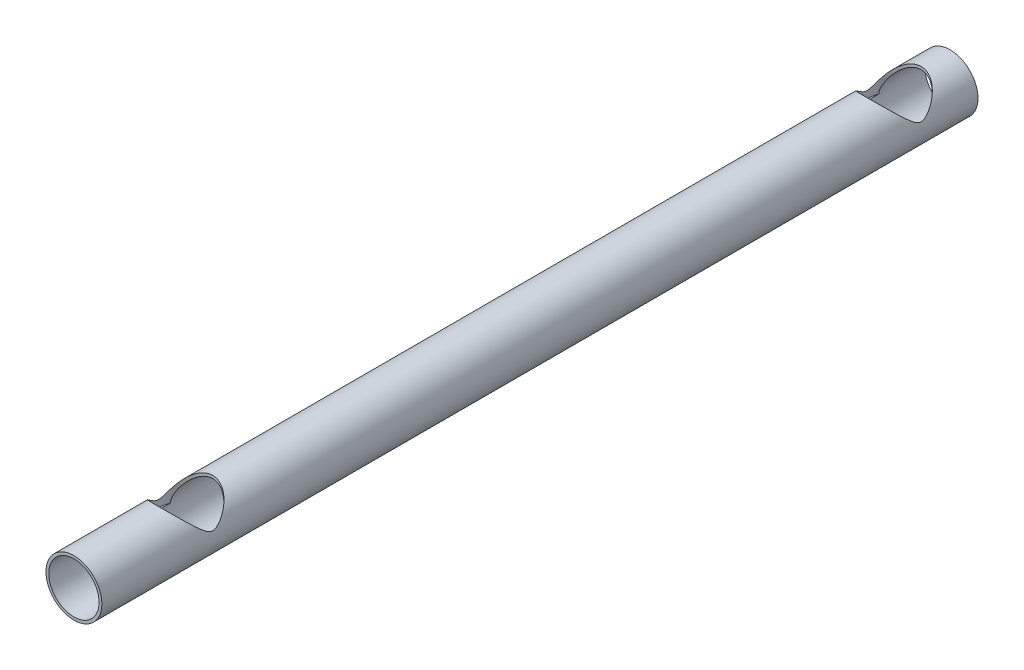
ISO-10303-21;
HEADER;
FILE_DESCRIPTION(('STEP AP214'),'2;1');
FILE_NAME('part.step','',(''),(''),'','','');
FILE_SCHEMA(('AUTOMOTIVE_DESIGN { 1 0 10303 214 1 1 1 1 }'));
ENDSEC;
DATA;
#1=APPLICATION_CONTEXT('core data for automotive mechanical design processes');
#2=APPLICATION_PROTOCOL_DEFINITION('international standard','automotive_design',2000,#1);
#3=PRODUCT_CONTEXT('',#1,'mechanical');
#4=PRODUCT('Part','Part','',(#3));
#5=PRODUCT_RELATED_PRODUCT_CATEGORY('part','',(#4));
#6=PRODUCT_DEFINITION_FORMATION('','',#4);
#7=PRODUCT_DEFINITION_CONTEXT('part definition',#1,'design');
#8=PRODUCT_DEFINITION('design','',#6,#7);
#9=PRODUCT_DEFINITION_SHAPE('','',#8);
#10=(LENGTH_UNIT() NAMED_UNIT(*) SI_UNIT(.MILLI.,.METRE.));
#11=(NAMED_UNIT(*) PLANE_ANGLE_UNIT() SI_UNIT($,.RADIAN.));
#12=(NAMED_UNIT(*) SI_UNIT($,.STERADIAN.) SOLID_ANGLE_UNIT());
#13=UNCERTAINTY_MEASURE_WITH_UNIT(LENGTH_MEASURE(1.E-05),#10,'distance_accuracy_value','');
#14=(GEOMETRIC_REPRESENTATION_CONTEXT(3) GLOBAL_UNCERTAINTY_ASSIGNED_CONTEXT((#13)) GLOBAL_UNIT_ASSIGNED_CONTEXT((#10,
#11,#12)) REPRESENTATION_CONTEXT('',''));
#15=CARTESIAN_POINT('',(0.,0.,0.));
#16=DIRECTION('',(0.,0.,1.));
#17=DIRECTION('',(1.,0.,0.));
#18=AXIS2_PLACEMENT_3D('',#15,#16,#17);
#19=CARTESIAN_POINT('',(0.,0.,470.));
#20=DIRECTION('',(0.,0.,-1.));
#21=DIRECTION('',(-1.,0.,0.));
#22=AXIS2_PLACEMENT_3D('',#19,#20,#21);
#23=CYLINDRICAL_SURFACE('',#22,13.5);
#24=CARTESIAN_POINT('',(13.5,0.,35.2915026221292));
#25=CARTESIAN_POINT('',(13.5000021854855,0.0920984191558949,35.2914908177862));
#26=CARTESIAN_POINT('',(13.4990571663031,0.184176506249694,35.2939086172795));
#27=CARTESIAN_POINT('',(13.4952955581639,0.368020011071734,35.3034929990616));
#28=CARTESIAN_POINT('',(13.4924795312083,0.459785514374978,35.3106581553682));
#29=CARTESIAN_POINT('',(13.4812860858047,0.733609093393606,35.3390409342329));
#30=CARTESIAN_POINT('',(13.4701629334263,0.914881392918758,35.3671475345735));
#31=CARTESIAN_POINT('',(13.4413105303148,1.2697484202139,35.4389895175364));
#32=CARTESIAN_POINT('',(13.4237218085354,1.44342437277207,35.4823916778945));
#33=CARTESIAN_POINT('',(13.3824156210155,1.78628089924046,35.5824624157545));
#34=CARTESIAN_POINT('',(13.3586923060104,1.95545701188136,35.6391436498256));
#35=CARTESIAN_POINT('',(13.2909708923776,2.38091987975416,35.7974986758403));
#36=CARTESIAN_POINT('',(13.2430095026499,2.63374643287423,35.9067379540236));
#37=CARTESIAN_POINT('',(13.1350291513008,3.12811757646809,36.1431200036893));
#38=CARTESIAN_POINT('',(13.0750028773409,3.36965521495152,36.2702736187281));
#39=CARTESIAN_POINT('',(12.9430466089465,3.84568328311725,36.5383603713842));
#40=CARTESIAN_POINT('',(12.8709778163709,4.08004866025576,36.6794452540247));
#41=CARTESIAN_POINT('',(12.7160787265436,4.53984330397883,36.9698234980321));
#42=CARTESIAN_POINT('',(12.6332501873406,4.76527402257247,37.1191155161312));
#43=CARTESIAN_POINT('',(12.4609078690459,5.19882842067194,37.4164713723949));
#44=CARTESIAN_POINT('',(12.3718325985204,5.40727979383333,37.5643137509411));
#45=CARTESIAN_POINT('',(12.1842077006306,5.81773178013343,37.8629635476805));
#46=CARTESIAN_POINT('',(12.085656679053,6.01973143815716,38.0137713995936));
#47=CARTESIAN_POINT('',(11.8790522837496,6.41782155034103,38.3169580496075));
#48=CARTESIAN_POINT('',(11.7709932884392,6.61390841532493,38.4693377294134));
#49=CARTESIAN_POINT('',(11.5453799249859,7.00030254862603,38.774407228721));
#50=CARTESIAN_POINT('',(11.4278246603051,7.19060926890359,38.9270970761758));
#51=CARTESIAN_POINT('',(11.0617741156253,7.75152618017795,39.3828833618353));
#52=CARTESIAN_POINT('',(10.7990307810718,8.11379567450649,39.6849824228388));
#53=CARTESIAN_POINT('',(10.2347207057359,8.81491658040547,40.2795185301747));
#54=CARTESIAN_POINT('',(9.93317621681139,9.15378124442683,40.5719609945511));
#55=CARTESIAN_POINT('',(9.37388490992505,9.72084839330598,41.0671211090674));
#56=CARTESIAN_POINT('',(9.12517456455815,9.9548928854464,41.2733763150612));
#57=CARTESIAN_POINT('',(8.60553842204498,10.4073716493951,41.6748658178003));
#58=CARTESIAN_POINT('',(8.33461270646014,10.6258059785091,41.8701001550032));
#59=CARTESIAN_POINT('',(7.77069965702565,11.044886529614,42.2466764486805));
#60=CARTESIAN_POINT('',(7.47773235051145,11.2455485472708,42.4280307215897));
#61=CARTESIAN_POINT('',(6.86978700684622,11.626895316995,42.774125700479));
#62=CARTESIAN_POINT('',(6.55481403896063,11.8075846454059,42.9388702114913));
#63=CARTESIAN_POINT('',(5.97072293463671,12.1113748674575,43.2167490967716));
#64=CARTESIAN_POINT('',(5.70551446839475,12.2386733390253,43.3335260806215));
#65=CARTESIAN_POINT('',(5.16248203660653,12.4774479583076,43.5530254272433));
#66=CARTESIAN_POINT('',(4.88466091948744,12.5889276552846,43.6557509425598));
#67=CARTESIAN_POINT('',(4.31756473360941,12.7945126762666,43.8455043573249));
#68=CARTESIAN_POINT('',(4.02829413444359,12.8886247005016,43.9325383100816));
#69=CARTESIAN_POINT('',(3.43970686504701,13.0580313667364,44.0893988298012));
#70=CARTESIAN_POINT('',(3.14039008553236,13.1333258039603,44.1592252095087));
#71=CARTESIAN_POINT('',(2.53148011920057,13.2642099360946,44.2807096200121));
#72=CARTESIAN_POINT('',(2.22182832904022,13.3196534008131,44.3322328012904));
#73=CARTESIAN_POINT('',(1.59675452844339,13.4089534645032,44.4152614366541));
#74=CARTESIAN_POINT('',(1.28133250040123,13.4428099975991,44.4467668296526));
#75=CARTESIAN_POINT('',(0.647622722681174,13.4881968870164,44.4890091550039));
#76=CARTESIAN_POINT('',(0.329336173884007,13.4997361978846,44.4997544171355));
#77=CARTESIAN_POINT('',(-0.307254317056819,13.5002547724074,44.5002371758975));
#78=CARTESIAN_POINT('',(-0.625558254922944,13.489236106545,44.4899766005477));
#79=CARTESIAN_POINT('',(-1.22315644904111,13.4474219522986,44.4510590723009));
#80=CARTESIAN_POINT('',(-1.50276945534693,13.4190186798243,44.4246274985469));
#81=CARTESIAN_POINT('',(-2.05774519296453,13.3451875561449,44.3559690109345));
#82=CARTESIAN_POINT('',(-2.33310831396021,13.2997612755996,44.313743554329));
#83=CARTESIAN_POINT('',(-2.87786931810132,13.1926095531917,44.2142376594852));
#84=CARTESIAN_POINT('',(-3.14726692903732,13.1308833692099,44.1569565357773));
#85=CARTESIAN_POINT('',(-3.67861401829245,12.9920442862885,44.0282762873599));
#86=CARTESIAN_POINT('',(-3.94056306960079,12.9149305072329,43.9568763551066));
#87=CARTESIAN_POINT('',(-4.46491021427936,12.7433646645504,43.7982692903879));
#88=CARTESIAN_POINT('',(-4.72699642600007,12.6483957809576,43.710592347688));
#89=CARTESIAN_POINT('',(-5.24094169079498,12.444236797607,43.5224796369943));
#90=CARTESIAN_POINT('',(-5.49279675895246,12.3350412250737,43.4220389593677));
#91=CARTESIAN_POINT('',(-5.98548258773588,12.1036392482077,43.2096921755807));
#92=CARTESIAN_POINT('',(-6.2263116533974,11.981430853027,43.0977843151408));
#93=CARTESIAN_POINT('',(-6.69645145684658,11.7251545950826,42.8637679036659));
#94=CARTESIAN_POINT('',(-6.92575971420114,11.591084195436,42.7416571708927));
#95=CARTESIAN_POINT('',(-7.48953013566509,11.2391240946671,42.422155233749));
#96=CARTESIAN_POINT('',(-7.81620569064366,11.0140940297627,42.2188163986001));
#97=CARTESIAN_POINT('',(-8.44179967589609,10.5422800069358,41.7952890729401));
#98=CARTESIAN_POINT('',(-8.74070566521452,10.2954863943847,41.5750931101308));
#99=CARTESIAN_POINT('',(-9.31140897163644,9.78239092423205,41.1211875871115));
#100=CARTESIAN_POINT('',(-9.5831558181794,9.51605428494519,40.8874540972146));
#101=CARTESIAN_POINT('',(-10.0993721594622,8.96631819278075,40.4103883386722));
#102=CARTESIAN_POINT('',(-10.3438459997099,8.68292146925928,40.167057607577));
#103=CARTESIAN_POINT('',(-10.8117306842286,8.09330147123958,39.6683057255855));
#104=CARTESIAN_POINT('',(-11.0344960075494,7.78669382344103,39.4127345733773));
#105=CARTESIAN_POINT('',(-11.4527787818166,7.15728397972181,38.8990778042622));
#106=CARTESIAN_POINT('',(-11.6482882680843,6.83447708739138,38.6409914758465));
#107=CARTESIAN_POINT('',(-12.0125141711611,6.17192241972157,38.1270265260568));
#108=CARTESIAN_POINT('',(-12.1812140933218,5.83216438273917,37.8711493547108));
#109=CARTESIAN_POINT('',(-12.4139103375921,5.30859630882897,37.4944444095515));
#110=CARTESIAN_POINT('',(-12.4880717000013,5.1317856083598,37.3700834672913));
#111=CARTESIAN_POINT('',(-12.6295419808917,4.77303559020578,37.1249323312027));
#112=CARTESIAN_POINT('',(-12.6968519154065,4.59109703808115,37.0041416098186));
#113=CARTESIAN_POINT('',(-12.8214512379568,4.23025715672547,36.7732400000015));
#114=CARTESIAN_POINT('',(-12.8790638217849,4.05161850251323,36.6628941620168));
#115=CARTESIAN_POINT('',(-12.9876844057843,3.68862284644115,36.4486021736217));
#116=CARTESIAN_POINT('',(-13.0386942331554,3.50426744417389,36.3446542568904));
#117=CARTESIAN_POINT('',(-13.1334098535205,3.13056260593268,36.1461811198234));
#118=CARTESIAN_POINT('',(-13.177167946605,2.94126145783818,36.0515906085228));
#119=CARTESIAN_POINT('',(-13.2573352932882,2.55574122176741,35.8738879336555));
#120=CARTESIAN_POINT('',(-13.2937443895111,2.35952198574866,35.7907760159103));
#121=CARTESIAN_POINT('',(-13.3536065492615,1.99014814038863,35.6512009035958));
#122=CARTESIAN_POINT('',(-13.3781860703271,1.81798959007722,35.592608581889));
#123=CARTESIAN_POINT('',(-13.4209926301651,1.4689574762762,35.4890889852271));
#124=CARTESIAN_POINT('',(-13.4392256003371,1.29208848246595,35.4441489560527));
#125=CARTESIAN_POINT('',(-13.4691060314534,0.930904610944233,35.3698091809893));
#126=CARTESIAN_POINT('',(-13.4806211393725,0.746512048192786,35.3407224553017));
#127=CARTESIAN_POINT('',(-13.4922111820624,0.467912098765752,35.3113405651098));
#128=CARTESIAN_POINT('',(-13.495127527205,0.374532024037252,35.3039208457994));
#129=CARTESIAN_POINT('',(-13.499023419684,0.187441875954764,35.2939947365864));
#130=CARTESIAN_POINT('',(-13.5000023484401,0.0937317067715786,35.2914899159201));
#131=CARTESIAN_POINT('',(-13.5,0.,35.2915026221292));
#132=B_SPLINE_CURVE_WITH_KNOTS('',3,(#24,#25,#26,#27,#28,#29,#30,#31,#32,#33,#34,#35,#36,#37,
#38,#39,#40,#41,#42,#43,#44,#45,#46,#47,#48,#49,#50,#51,#52,#53,#54,#55,#56,#57,#58,#59,#60,#61,
#62,#63,#64,#65,#66,#67,#68,#69,#70,#71,#72,#73,#74,#75,#76,#77,#78,#79,#80,#81,#82,#83,#84,#85,
#86,#87,#88,#89,#90,#91,#92,#93,#94,#95,#96,#97,#98,#99,#100,#101,#102,#103,#104,#105,#106,#107,
#108,#109,#110,#111,#112,#113,#114,#115,#116,#117,#118,#119,#120,#121,#122,#123,#124,#125,#126,
#127,#128,#129,#130,#131),.UNSPECIFIED.,.F.,.F.,(4,2,2,2,2,2,2,2,2,2,2,2,2,2,2,2,2,2,2,2,2,2,2,
2,2,2,2,2,2,2,2,2,2,2,2,2,2,2,2,2,2,2,2,2,2,2,2,2,2,2,2,2,2,4),(0.,0.276220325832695,
0.552357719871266,1.10258243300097,1.64149408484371,2.18092148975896,3.01809462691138,
3.85577670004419,4.7038799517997,5.55184480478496,6.36347665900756,7.1752281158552,
7.9874627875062,8.79977423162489,10.4176009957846,12.0345040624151,13.230448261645,
14.4263880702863,15.621254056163,16.8158456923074,17.764499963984,18.7129410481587,
19.6610154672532,20.609100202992,21.5640317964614,22.5189663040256,23.4735175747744,
24.4279812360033,25.2738733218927,26.1196873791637,26.9655399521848,27.8114409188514,
28.6872640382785,29.5634250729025,30.4397203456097,31.3162034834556,32.6514751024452,
33.9873420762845,35.325647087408,36.6637385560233,38.0339112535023,39.4044835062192,
40.7758957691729,41.4613496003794,42.1467016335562,42.7996710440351,43.452459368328,
44.100312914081,44.7481803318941,45.298133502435,45.8475713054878,46.4074972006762,
46.6885234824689,46.9696394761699),.UNSPECIFIED.);
#133=CARTESIAN_POINT('',(13.5,0.,35.2915026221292));
#134=VERTEX_POINT('',#133);
#135=CARTESIAN_POINT('',(-13.5,0.,35.2915026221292));
#136=VERTEX_POINT('',#135);
#137=EDGE_CURVE('E115',#134,#136,#132,.T.);
#138=ORIENTED_EDGE('',*,*,#137,.F.);
#139=DIRECTION('',(0.,0.,-1.));
#140=VECTOR('',#139,1.);
#141=CARTESIAN_POINT('',(13.5,0.,470.));
#142=LINE('',#141,#140);
#143=CARTESIAN_POINT('',(13.5,0.,24.7084973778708));
#144=VERTEX_POINT('',#143);
#145=EDGE_CURVE('E112',#134,#144,#142,.T.);
#146=ORIENTED_EDGE('',*,*,#145,.T.);
#147=CARTESIAN_POINT('',(-13.5,0.,24.7084973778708));
#148=CARTESIAN_POINT('',(-13.5000021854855,0.092098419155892,24.7085091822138));
#149=CARTESIAN_POINT('',(-13.4990571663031,0.184176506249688,24.7060913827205));
#150=CARTESIAN_POINT('',(-13.4952955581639,0.368020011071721,24.6965070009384));
#151=CARTESIAN_POINT('',(-13.4924795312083,0.459785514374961,24.6893418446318));
#152=CARTESIAN_POINT('',(-13.4812860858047,0.73360909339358,24.6609590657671));
#153=CARTESIAN_POINT('',(-13.4701629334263,0.914881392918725,24.6328524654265));
#154=CARTESIAN_POINT('',(-13.4413105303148,1.26974842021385,24.5610104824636));
#155=CARTESIAN_POINT('',(-13.4237218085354,1.44342437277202,24.5176083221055));
#156=CARTESIAN_POINT('',(-13.3824156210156,1.7862808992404,24.4175375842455));
#157=CARTESIAN_POINT('',(-13.3586923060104,1.9554570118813,24.3608563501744));
#158=CARTESIAN_POINT('',(-13.2909708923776,2.38091987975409,24.2025013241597));
#159=CARTESIAN_POINT('',(-13.24300950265,2.63374643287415,24.0932620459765));
#160=CARTESIAN_POINT('',(-13.1350291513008,3.12811757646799,23.8568799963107));
#161=CARTESIAN_POINT('',(-13.075002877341,3.36965521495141,23.729726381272));
#162=CARTESIAN_POINT('',(-12.9430466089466,3.84568328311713,23.4616396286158));
#163=CARTESIAN_POINT('',(-12.8709778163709,4.08004866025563,23.3205547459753));
#164=CARTESIAN_POINT('',(-12.7160787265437,4.53984330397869,23.030176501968));
#165=CARTESIAN_POINT('',(-12.6332501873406,4.76527402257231,22.8808844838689));
#166=CARTESIAN_POINT('',(-12.460907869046,5.19882842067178,22.5835286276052));
#167=CARTESIAN_POINT('',(-12.3718325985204,5.40727979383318,22.435686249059));
#168=CARTESIAN_POINT('',(-12.1842077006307,5.81773178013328,22.1370364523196));
#169=CARTESIAN_POINT('',(-12.085656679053,6.01973143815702,21.9862286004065));
#170=CARTESIAN_POINT('',(-11.8790522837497,6.4178215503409,21.6830419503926));
#171=CARTESIAN_POINT('',(-11.7709932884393,6.61390841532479,21.5306622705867));
#172=CARTESIAN_POINT('',(-11.545379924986,7.0003025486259,21.2255927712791));
#173=CARTESIAN_POINT('',(-11.4278246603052,7.19060926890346,21.0729029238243));
#174=CARTESIAN_POINT('',(-11.0617741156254,7.75152618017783,20.6171166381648));
#175=CARTESIAN_POINT('',(-10.7990307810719,8.11379567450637,20.3150175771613));
#176=CARTESIAN_POINT('',(-10.234720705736,8.81491658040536,19.7204814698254));
#177=CARTESIAN_POINT('',(-9.93317621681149,9.15378124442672,19.4280390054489));
#178=CARTESIAN_POINT('',(-9.37388490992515,9.72084839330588,18.9328788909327));
#179=CARTESIAN_POINT('',(-9.12517456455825,9.9548928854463,18.7266236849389));
#180=CARTESIAN_POINT('',(-8.60553842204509,10.4073716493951,18.3251341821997));
#181=CARTESIAN_POINT('',(-8.33461270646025,10.625805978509,18.1298998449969));
#182=CARTESIAN_POINT('',(-7.77069965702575,11.0448865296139,17.7533235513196));
#183=CARTESIAN_POINT('',(-7.47773235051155,11.2455485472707,17.5719692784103));
#184=CARTESIAN_POINT('',(-6.86978700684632,11.6268953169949,17.2258742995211));
#185=CARTESIAN_POINT('',(-6.55481403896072,11.8075846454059,17.0611297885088));
#186=CARTESIAN_POINT('',(-5.9707229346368,12.1113748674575,16.7832509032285));
#187=CARTESIAN_POINT('',(-5.70551446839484,12.2386733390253,16.6664739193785));
#188=CARTESIAN_POINT('',(-5.16248203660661,12.4774479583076,16.4469745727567));
#189=CARTESIAN_POINT('',(-4.88466091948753,12.5889276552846,16.3442490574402));
#190=CARTESIAN_POINT('',(-4.31756473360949,12.7945126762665,16.1544956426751));
#191=CARTESIAN_POINT('',(-4.02829413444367,12.8886247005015,16.0674616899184));
#192=CARTESIAN_POINT('',(-3.43970686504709,13.0580313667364,15.9106011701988));
#193=CARTESIAN_POINT('',(-3.14039008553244,13.1333258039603,15.8407747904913));
#194=CARTESIAN_POINT('',(-2.53148011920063,13.2642099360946,15.7192903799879));
#195=CARTESIAN_POINT('',(-2.22182832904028,13.3196534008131,15.6677671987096));
#196=CARTESIAN_POINT('',(-1.59675452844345,13.4089534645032,15.5847385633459));
#197=CARTESIAN_POINT('',(-1.28133250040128,13.4428099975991,15.5532331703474));
#198=CARTESIAN_POINT('',(-0.647622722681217,13.4881968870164,15.5109908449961));
#199=CARTESIAN_POINT('',(-0.329336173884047,13.4997361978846,15.5002455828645));
#200=CARTESIAN_POINT('',(0.307254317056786,13.5002547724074,15.4997628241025));
#201=CARTESIAN_POINT('',(0.625558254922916,13.489236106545,15.5100233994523));
#202=CARTESIAN_POINT('',(1.22315644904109,13.4474219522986,15.5489409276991));
#203=CARTESIAN_POINT('',(1.50276945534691,13.4190186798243,15.5753725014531));
#204=CARTESIAN_POINT('',(2.05774519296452,13.3451875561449,15.6440309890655));
#205=CARTESIAN_POINT('',(2.3331083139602,13.2997612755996,15.686256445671));
#206=CARTESIAN_POINT('',(2.87786931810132,13.1926095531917,15.7857623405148));
#207=CARTESIAN_POINT('',(3.14726692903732,13.1308833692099,15.8430434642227));
#208=CARTESIAN_POINT('',(3.67861401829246,12.9920442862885,15.9717237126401));
#209=CARTESIAN_POINT('',(3.94056306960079,12.9149305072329,16.0431236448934));
#210=CARTESIAN_POINT('',(4.46491021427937,12.7433646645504,16.2017307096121));
#211=CARTESIAN_POINT('',(4.72699642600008,12.6483957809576,16.289407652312));
#212=CARTESIAN_POINT('',(5.240941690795,12.444236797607,16.4775203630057));
#213=CARTESIAN_POINT('',(5.49279675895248,12.3350412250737,16.5779610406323));
#214=CARTESIAN_POINT('',(5.9854825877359,12.1036392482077,16.7903078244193));
#215=CARTESIAN_POINT('',(6.22631165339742,11.981430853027,16.9022156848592));
#216=CARTESIAN_POINT('',(6.6964514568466,11.7251545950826,17.1362320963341));
#217=CARTESIAN_POINT('',(6.92575971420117,11.5910841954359,17.2583428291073));
#218=CARTESIAN_POINT('',(7.48953013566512,11.2391240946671,17.577844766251));
#219=CARTESIAN_POINT('',(7.81620569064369,11.0140940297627,17.7811836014));
#220=CARTESIAN_POINT('',(8.44179967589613,10.5422800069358,18.2047109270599));
#221=CARTESIAN_POINT('',(8.74070566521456,10.2954863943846,18.4249068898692));
#222=CARTESIAN_POINT('',(9.31140897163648,9.78239092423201,18.8788124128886));
#223=CARTESIAN_POINT('',(9.58315581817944,9.51605428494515,19.1125459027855));
#224=CARTESIAN_POINT('',(10.0993721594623,8.9663181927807,19.5896116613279));
#225=CARTESIAN_POINT('',(10.3438459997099,8.68292146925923,19.8329423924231));
#226=CARTESIAN_POINT('',(10.8117306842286,8.09330147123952,20.3316942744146));
#227=CARTESIAN_POINT('',(11.0344960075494,7.78669382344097,20.5872654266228));
#228=CARTESIAN_POINT('',(11.4527787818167,7.15728397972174,21.1009221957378));
#229=CARTESIAN_POINT('',(11.6482882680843,6.83447708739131,21.3590085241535));
#230=CARTESIAN_POINT('',(12.0125141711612,6.17192241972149,21.8729734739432));
#231=CARTESIAN_POINT('',(12.1812140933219,5.83216438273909,22.1288506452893));
#232=CARTESIAN_POINT('',(12.4139103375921,5.30859630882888,22.5055555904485));
#233=CARTESIAN_POINT('',(12.4880717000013,5.13178560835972,22.6299165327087));
#234=CARTESIAN_POINT('',(12.6295419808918,4.77303559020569,22.8750676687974));
#235=CARTESIAN_POINT('',(12.6968519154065,4.59109703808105,22.9958583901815));
#236=CARTESIAN_POINT('',(12.8214512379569,4.23025715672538,23.2267599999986));
#237=CARTESIAN_POINT('',(12.8790638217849,4.05161850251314,23.3371058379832));
#238=CARTESIAN_POINT('',(12.9876844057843,3.68862284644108,23.5513978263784));
#239=CARTESIAN_POINT('',(13.0386942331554,3.50426744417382,23.6553457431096));
#240=CARTESIAN_POINT('',(13.1334098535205,3.13056260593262,23.8538188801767));
#241=CARTESIAN_POINT('',(13.177167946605,2.94126145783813,23.9484093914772));
#242=CARTESIAN_POINT('',(13.2573352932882,2.55574122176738,24.1261120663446));
#243=CARTESIAN_POINT('',(13.2937443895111,2.35952198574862,24.2092239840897));
#244=CARTESIAN_POINT('',(13.3536065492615,1.99014814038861,24.3487990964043));
#245=CARTESIAN_POINT('',(13.3781860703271,1.81798959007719,24.407391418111));
#246=CARTESIAN_POINT('',(13.4209926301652,1.46895747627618,24.5109110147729));
#247=CARTESIAN_POINT('',(13.4392256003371,1.29208848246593,24.5558510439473));
#248=CARTESIAN_POINT('',(13.4691060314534,0.930904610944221,24.6301908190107));
#249=CARTESIAN_POINT('',(13.4806211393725,0.746512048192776,24.6592775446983));
#250=CARTESIAN_POINT('',(13.4922111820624,0.467912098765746,24.6886594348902));
#251=CARTESIAN_POINT('',(13.495127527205,0.374532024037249,24.6960791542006));
#252=CARTESIAN_POINT('',(13.499023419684,0.187441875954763,24.7060052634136));
#253=CARTESIAN_POINT('',(13.5000023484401,0.0937317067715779,24.7085100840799));
#254=CARTESIAN_POINT('',(13.5,0.,24.7084973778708));
#255=B_SPLINE_CURVE_WITH_KNOTS('',3,(#147,#148,#149,#150,#151,#152,#153,#154,#155,#156,#157,
#158,#159,#160,#161,#162,#163,#164,#165,#166,#167,#168,#169,#170,#171,#172,#173,#174,#175,#176,
#177,#178,#179,#180,#181,#182,#183,#184,#185,#186,#187,#188,#189,#190,#191,#192,#193,#194,#195,
#196,#197,#198,#199,#200,#201,#202,#203,#204,#205,#206,#207,#208,#209,#210,#211,#212,#213,#214,
#215,#216,#217,#218,#219,#220,#221,#222,#223,#224,#225,#226,#227,#228,#229,#230,#231,#232,#233,
#234,#235,#236,#237,#238,#239,#240,#241,#242,#243,#244,#245,#246,#247,#248,#249,#250,#251,#252,
#253,#254),.UNSPECIFIED.,.F.,.F.,(4,2,2,2,2,2,2,2,2,2,2,2,2,2,2,2,2,2,2,2,2,2,2,2,2,2,2,2,2,2,2,
2,2,2,2,2,2,2,2,2,2,2,2,2,2,2,2,2,2,2,2,2,2,4),(0.,0.276220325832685,0.552357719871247,
1.10258243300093,1.64149408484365,2.18092148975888,3.01809462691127,3.85577670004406,
4.70387995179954,5.55184480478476,6.36347665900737,7.17522811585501,7.98746278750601,
8.79977423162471,10.4176009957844,12.0345040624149,13.2304482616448,14.4263880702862,
15.6212540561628,16.8158456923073,17.7644999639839,18.7129410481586,19.6610154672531,
20.609100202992,21.5640317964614,22.5189663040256,23.4735175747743,24.4279812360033,
25.2738733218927,26.1196873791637,26.9655399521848,27.8114409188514,28.6872640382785,
29.5634250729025,30.4397203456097,31.3162034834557,32.6514751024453,33.9873420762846,
35.325647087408,36.6637385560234,38.0339112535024,39.4044835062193,40.7758957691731,
41.4613496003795,42.1467016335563,42.7996710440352,43.452459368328,44.1003129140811,
44.7481803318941,45.298133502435,45.8475713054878,46.4074972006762,46.6885234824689,
46.9696394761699),.UNSPECIFIED.);
#256=CARTESIAN_POINT('',(-13.5,0.,24.7084973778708));
#257=VERTEX_POINT('',#256);
#258=EDGE_CURVE('E120',#257,#144,#255,.T.);
#259=ORIENTED_EDGE('',*,*,#258,.F.);
#260=DIRECTION('',(0.,0.,-1.));
#261=VECTOR('',#260,1.);
#262=CARTESIAN_POINT('',(-13.5,0.,470.));
#263=LINE('',#262,#261);
#264=EDGE_CURVE('E149',#257,#136,#263,.F.);
#265=ORIENTED_EDGE('',*,*,#264,.T.);
#266=EDGE_LOOP('',(#138,#146,#259,#265));
#267=FACE_BOUND('',#266,.T.);
#268=CARTESIAN_POINT('',(0.,0.,470.));
#269=DIRECTION('',(0.,0.,1.));
#270=DIRECTION('',(1.,0.,0.));
#271=AXIS2_PLACEMENT_3D('',#268,#269,#270);
#272=CIRCLE('',#271,13.5);
#273=CARTESIAN_POINT('',(13.5,0.,470.));
#274=VERTEX_POINT('',#273);
#275=EDGE_CURVE('E140',#274,#274,#272,.T.);
#276=ORIENTED_EDGE('',*,*,#275,.T.);
#277=EDGE_LOOP('',(#276));
#278=FACE_BOUND('',#277,.T.);
#279=CARTESIAN_POINT('',(0.,0.,0.));
#280=DIRECTION('',(0.,0.,1.));
#281=DIRECTION('',(1.,0.,0.));
#282=AXIS2_PLACEMENT_3D('',#279,#280,#281);
#283=CIRCLE('',#282,13.5);
#284=CARTESIAN_POINT('',(13.5,0.,0.));
#285=VERTEX_POINT('',#284);
#286=EDGE_CURVE('E138',#285,#285,#283,.T.);
#287=ORIENTED_EDGE('',*,*,#286,.F.);
#288=EDGE_LOOP('',(#287));
#289=FACE_BOUND('',#288,.T.);
#290=CARTESIAN_POINT('',(13.5,0.,415.291502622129));
#291=CARTESIAN_POINT('',(13.5000021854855,0.0920984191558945,415.291490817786));
#292=CARTESIAN_POINT('',(13.4990571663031,0.184176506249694,415.293908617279));
#293=CARTESIAN_POINT('',(13.4952955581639,0.368020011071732,415.303492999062));
#294=CARTESIAN_POINT('',(13.4924795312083,0.459785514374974,415.310658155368));
#295=CARTESIAN_POINT('',(13.4812860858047,0.733609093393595,415.339040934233));
#296=CARTESIAN_POINT('',(13.4701629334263,0.914881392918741,415.367147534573));
#297=CARTESIAN_POINT('',(13.4413105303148,1.26974842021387,415.438989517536));
#298=CARTESIAN_POINT('',(13.4237218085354,1.44342437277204,415.482391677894));
#299=CARTESIAN_POINT('',(13.3824156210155,1.78628089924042,415.582462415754));
#300=CARTESIAN_POINT('',(13.3586923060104,1.95545701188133,415.639143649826));
#301=CARTESIAN_POINT('',(13.2909708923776,2.38091987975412,415.79749867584));
#302=CARTESIAN_POINT('',(13.2430095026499,2.63374643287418,415.906737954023));
#303=CARTESIAN_POINT('',(13.1350291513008,3.12811757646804,416.143120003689));
#304=CARTESIAN_POINT('',(13.0750028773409,3.36965521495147,416.270273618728));
#305=CARTESIAN_POINT('',(12.9430466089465,3.84568328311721,416.538360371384));
#306=CARTESIAN_POINT('',(12.8709778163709,4.08004866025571,416.679445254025));
#307=CARTESIAN_POINT('',(12.7160787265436,4.53984330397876,416.969823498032));
#308=CARTESIAN_POINT('',(12.6332501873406,4.76527402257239,417.119115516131));
#309=CARTESIAN_POINT('',(12.4609078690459,5.19882842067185,417.416471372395));
#310=CARTESIAN_POINT('',(12.3718325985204,5.40727979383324,417.564313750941));
#311=CARTESIAN_POINT('',(12.1842077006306,5.81773178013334,417.86296354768));
#312=CARTESIAN_POINT('',(12.085656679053,6.01973143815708,418.013771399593));
#313=CARTESIAN_POINT('',(11.8790522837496,6.41782155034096,418.316958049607));
#314=CARTESIAN_POINT('',(11.7709932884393,6.61390841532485,418.469337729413));
#315=CARTESIAN_POINT('',(11.545379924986,7.00030254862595,418.774407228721));
#316=CARTESIAN_POINT('',(11.4278246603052,7.19060926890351,418.927097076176));
#317=CARTESIAN_POINT('',(11.0617741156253,7.75152618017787,419.382883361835));
#318=CARTESIAN_POINT('',(10.7990307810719,8.11379567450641,419.684982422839));
#319=CARTESIAN_POINT('',(10.234720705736,8.8149165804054,420.279518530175));
#320=CARTESIAN_POINT('',(9.93317621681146,9.15378124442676,420.571960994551));
#321=CARTESIAN_POINT('',(9.37388490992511,9.72084839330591,421.067121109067));
#322=CARTESIAN_POINT('',(9.12517456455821,9.95489288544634,421.273376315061));
#323=CARTESIAN_POINT('',(8.60553842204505,10.4073716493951,421.6748658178));
#324=CARTESIAN_POINT('',(8.33461270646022,10.625805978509,421.870100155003));
#325=CARTESIAN_POINT('',(7.77069965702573,11.044886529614,422.24667644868));
#326=CARTESIAN_POINT('',(7.47773235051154,11.2455485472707,422.42803072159));
#327=CARTESIAN_POINT('',(6.8697870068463,11.6268953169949,422.774125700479));
#328=CARTESIAN_POINT('',(6.5548140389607,11.8075846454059,422.938870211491));
#329=CARTESIAN_POINT('',(5.97072293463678,12.1113748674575,423.216749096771));
#330=CARTESIAN_POINT('',(5.70551446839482,12.2386733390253,423.333526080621));
#331=CARTESIAN_POINT('',(5.16248203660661,12.4774479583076,423.553025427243));
#332=CARTESIAN_POINT('',(4.88466091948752,12.5889276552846,423.65575094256));
#333=CARTESIAN_POINT('',(4.31756473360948,12.7945126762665,423.845504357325));
#334=CARTESIAN_POINT('',(4.02829413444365,12.8886247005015,423.932538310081));
#335=CARTESIAN_POINT('',(3.43970686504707,13.0580313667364,424.089398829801));
#336=CARTESIAN_POINT('',(3.14039008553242,13.1333258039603,424.159225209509));
#337=CARTESIAN_POINT('',(2.53148011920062,13.2642099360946,424.280709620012));
#338=CARTESIAN_POINT('',(2.22182832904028,13.3196534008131,424.33223280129));
#339=CARTESIAN_POINT('',(1.59675452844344,13.4089534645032,424.415261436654));
#340=CARTESIAN_POINT('',(1.28133250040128,13.4428099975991,424.446766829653));
#341=CARTESIAN_POINT('',(0.647622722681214,13.4881968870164,424.489009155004));
#342=CARTESIAN_POINT('',(0.329336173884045,13.4997361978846,424.499754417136));
#343=CARTESIAN_POINT('',(-0.307254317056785,13.5002547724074,424.500237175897));
#344=CARTESIAN_POINT('',(-0.625558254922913,13.489236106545,424.489976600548));
#345=CARTESIAN_POINT('',(-1.22315644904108,13.4474219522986,424.451059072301));
#346=CARTESIAN_POINT('',(-1.5027694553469,13.4190186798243,424.424627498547));
#347=CARTESIAN_POINT('',(-2.05774519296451,13.3451875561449,424.355969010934));
#348=CARTESIAN_POINT('',(-2.33310831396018,13.2997612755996,424.313743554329));
#349=CARTESIAN_POINT('',(-2.8778693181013,13.1926095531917,424.214237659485));
#350=CARTESIAN_POINT('',(-3.1472669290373,13.1308833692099,424.156956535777));
#351=CARTESIAN_POINT('',(-3.67861401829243,12.9920442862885,424.02827628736));
#352=CARTESIAN_POINT('',(-3.94056306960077,12.9149305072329,423.956876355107));
#353=CARTESIAN_POINT('',(-4.46491021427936,12.7433646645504,423.798269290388));
#354=CARTESIAN_POINT('',(-4.72699642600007,12.6483957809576,423.710592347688));
#355=CARTESIAN_POINT('',(-5.24094169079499,12.444236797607,423.522479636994));
#356=CARTESIAN_POINT('',(-5.49279675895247,12.3350412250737,423.422038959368));
#357=CARTESIAN_POINT('',(-5.98548258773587,12.1036392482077,423.209692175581));
#358=CARTESIAN_POINT('',(-6.22631165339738,11.9814308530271,423.097784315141));
#359=CARTESIAN_POINT('',(-6.69645145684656,11.7251545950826,422.863767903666));
#360=CARTESIAN_POINT('',(-6.92575971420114,11.591084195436,422.741657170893));
#361=CARTESIAN_POINT('',(-7.48953013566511,11.2391240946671,422.422155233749));
#362=CARTESIAN_POINT('',(-7.81620569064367,11.0140940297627,422.2188163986));
#363=CARTESIAN_POINT('',(-8.4417996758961,10.5422800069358,421.79528907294));
#364=CARTESIAN_POINT('',(-8.74070566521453,10.2954863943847,421.575093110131));
#365=CARTESIAN_POINT('',(-9.31140897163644,9.78239092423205,421.121187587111));
#366=CARTESIAN_POINT('',(-9.5831558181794,9.51605428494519,420.887454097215));
#367=CARTESIAN_POINT('',(-10.0993721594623,8.96631819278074,420.410388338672));
#368=CARTESIAN_POINT('',(-10.3438459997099,8.68292146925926,420.167057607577));
#369=CARTESIAN_POINT('',(-10.8117306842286,8.09330147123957,419.668305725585));
#370=CARTESIAN_POINT('',(-11.0344960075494,7.78669382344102,419.412734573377));
#371=CARTESIAN_POINT('',(-11.4527787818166,7.15728397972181,418.899077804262));
#372=CARTESIAN_POINT('',(-11.6482882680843,6.83447708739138,418.640991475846));
#373=CARTESIAN_POINT('',(-12.0125141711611,6.17192241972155,418.127026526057));
#374=CARTESIAN_POINT('',(-12.1812140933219,5.83216438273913,417.871149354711));
#375=CARTESIAN_POINT('',(-12.4139103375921,5.30859630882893,417.494444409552));
#376=CARTESIAN_POINT('',(-12.4880717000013,5.13178560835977,417.370083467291));
#377=CARTESIAN_POINT('',(-12.6295419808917,4.77303559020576,417.124932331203));
#378=CARTESIAN_POINT('',(-12.6968519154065,4.59109703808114,417.004141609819));
#379=CARTESIAN_POINT('',(-12.8214512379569,4.23025715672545,416.773240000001));
#380=CARTESIAN_POINT('',(-12.8790638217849,4.05161850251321,416.662894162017));
#381=CARTESIAN_POINT('',(-12.9876844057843,3.68862284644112,416.448602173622));
#382=CARTESIAN_POINT('',(-13.0386942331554,3.50426744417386,416.34465425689));
#383=CARTESIAN_POINT('',(-13.1334098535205,3.13056260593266,416.146181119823));
#384=CARTESIAN_POINT('',(-13.177167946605,2.94126145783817,416.051590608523));
#385=CARTESIAN_POINT('',(-13.2573352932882,2.5557412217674,415.873887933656));
#386=CARTESIAN_POINT('',(-13.2937443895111,2.35952198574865,415.79077601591));
#387=CARTESIAN_POINT('',(-13.3536065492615,1.99014814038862,415.651200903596));
#388=CARTESIAN_POINT('',(-13.3781860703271,1.81798959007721,415.592608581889));
#389=CARTESIAN_POINT('',(-13.4209926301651,1.46895747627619,415.489088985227));
#390=CARTESIAN_POINT('',(-13.4392256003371,1.29208848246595,415.444148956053));
#391=CARTESIAN_POINT('',(-13.4691060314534,0.930904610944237,415.369809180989));
#392=CARTESIAN_POINT('',(-13.4806211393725,0.746512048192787,415.340722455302));
#393=CARTESIAN_POINT('',(-13.4922111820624,0.467912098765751,415.31134056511));
#394=CARTESIAN_POINT('',(-13.495127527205,0.37453202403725,415.303920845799));
#395=CARTESIAN_POINT('',(-13.499023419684,0.187441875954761,415.293994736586));
#396=CARTESIAN_POINT('',(-13.5000023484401,0.0937317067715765,415.29148991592));
#397=CARTESIAN_POINT('',(-13.5,0.,415.291502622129));
#398=B_SPLINE_CURVE_WITH_KNOTS('',3,(#290,#291,#292,#293,#294,#295,#296,#297,#298,#299,#300,
#301,#302,#303,#304,#305,#306,#307,#308,#309,#310,#311,#312,#313,#314,#315,#316,#317,#318,#319,
#320,#321,#322,#323,#324,#325,#326,#327,#328,#329,#330,#331,#332,#333,#334,#335,#336,#337,#338,
#339,#340,#341,#342,#343,#344,#345,#346,#347,#348,#349,#350,#351,#352,#353,#354,#355,#356,#357,
#358,#359,#360,#361,#362,#363,#364,#365,#366,#367,#368,#369,#370,#371,#372,#373,#374,#375,#376,
#377,#378,#379,#380,#381,#382,#383,#384,#385,#386,#387,#388,#389,#390,#391,#392,#393,#394,#395,
#396,#397),.UNSPECIFIED.,.F.,.F.,(4,2,2,2,2,2,2,2,2,2,2,2,2,2,2,2,2,2,2,2,2,2,2,2,2,2,2,2,2,2,2,
2,2,2,2,2,2,2,2,2,2,2,2,2,2,2,2,2,2,2,2,2,2,4),(0.,0.276220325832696,0.552357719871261,
1.10258243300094,1.64149408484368,2.18092148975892,3.01809462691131,3.85577670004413,
4.70387995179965,5.55184480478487,6.36347665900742,7.1752281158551,7.9874627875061,
8.7997742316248,10.4176009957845,12.0345040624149,13.2304482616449,14.4263880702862,
15.6212540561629,16.8158456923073,17.7644999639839,18.7129410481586,19.6610154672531,
20.609100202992,21.5640317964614,22.5189663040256,23.4735175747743,24.4279812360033,
25.2738733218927,26.1196873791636,26.9655399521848,27.8114409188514,28.6872640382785,
29.5634250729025,30.4397203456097,31.3162034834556,32.6514751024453,33.9873420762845,
35.325647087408,36.6637385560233,38.0339112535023,39.4044835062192,40.775895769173,
41.4613496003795,42.1467016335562,42.7996710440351,43.452459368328,44.100312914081,
44.7481803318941,45.298133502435,45.8475713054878,46.4074972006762,46.6885234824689,
46.9696394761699),.UNSPECIFIED.);
#399=CARTESIAN_POINT('',(13.5,0.,415.291502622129));
#400=VERTEX_POINT('',#399);
#401=CARTESIAN_POINT('',(-13.5,0.,415.291502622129));
#402=VERTEX_POINT('',#401);
#403=EDGE_CURVE('E80',#400,#402,#398,.T.);
#404=ORIENTED_EDGE('',*,*,#403,.F.);
#405=DIRECTION('',(0.,0.,-1.));
#406=VECTOR('',#405,1.);
#407=CARTESIAN_POINT('',(13.5,0.,470.));
#408=LINE('',#407,#406);
#409=CARTESIAN_POINT('',(13.5,0.,404.708497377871));
#410=VERTEX_POINT('',#409);
#411=EDGE_CURVE('E11',#400,#410,#408,.T.);
#412=ORIENTED_EDGE('',*,*,#411,.T.);
#413=CARTESIAN_POINT('',(-13.5,0.,404.708497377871));
#414=CARTESIAN_POINT('',(-13.5000021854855,0.0920984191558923,404.708509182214));
#415=CARTESIAN_POINT('',(-13.4990571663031,0.184176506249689,404.70609138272));
#416=CARTESIAN_POINT('',(-13.4952955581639,0.368020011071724,404.696507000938));
#417=CARTESIAN_POINT('',(-13.4924795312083,0.459785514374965,404.689341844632));
#418=CARTESIAN_POINT('',(-13.4812860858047,0.733609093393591,404.660959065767));
#419=CARTESIAN_POINT('',(-13.4701629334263,0.914881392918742,404.632852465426));
#420=CARTESIAN_POINT('',(-13.4413105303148,1.26974842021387,404.561010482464));
#421=CARTESIAN_POINT('',(-13.4237218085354,1.44342437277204,404.517608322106));
#422=CARTESIAN_POINT('',(-13.3824156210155,1.78628089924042,404.417537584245));
#423=CARTESIAN_POINT('',(-13.3586923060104,1.95545701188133,404.360856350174));
#424=CARTESIAN_POINT('',(-13.2909708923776,2.38091987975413,404.20250132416));
#425=CARTESIAN_POINT('',(-13.2430095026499,2.6337464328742,404.093262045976));
#426=CARTESIAN_POINT('',(-13.1350291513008,3.12811757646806,403.856879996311));
#427=CARTESIAN_POINT('',(-13.0750028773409,3.36965521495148,403.729726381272));
#428=CARTESIAN_POINT('',(-12.9430466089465,3.84568328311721,403.461639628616));
#429=CARTESIAN_POINT('',(-12.8709778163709,4.08004866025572,403.320554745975));
#430=CARTESIAN_POINT('',(-12.7160787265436,4.53984330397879,403.030176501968));
#431=CARTESIAN_POINT('',(-12.6332501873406,4.76527402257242,402.880884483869));
#432=CARTESIAN_POINT('',(-12.4609078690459,5.19882842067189,402.583528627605));
#433=CARTESIAN_POINT('',(-12.3718325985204,5.40727979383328,402.435686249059));
#434=CARTESIAN_POINT('',(-12.1842077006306,5.81773178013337,402.137036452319));
#435=CARTESIAN_POINT('',(-12.085656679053,6.0197314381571,401.986228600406));
#436=CARTESIAN_POINT('',(-11.8790522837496,6.41782155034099,401.683041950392));
#437=CARTESIAN_POINT('',(-11.7709932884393,6.6139084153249,401.530662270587));
#438=CARTESIAN_POINT('',(-11.5453799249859,7.000302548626,401.225592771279));
#439=CARTESIAN_POINT('',(-11.4278246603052,7.19060926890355,401.072902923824));
#440=CARTESIAN_POINT('',(-11.0617741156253,7.7515261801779,400.617116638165));
#441=CARTESIAN_POINT('',(-10.7990307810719,8.11379567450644,400.315017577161));
#442=CARTESIAN_POINT('',(-10.234720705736,8.81491658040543,399.720481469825));
#443=CARTESIAN_POINT('',(-9.93317621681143,9.15378124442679,399.428039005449));
#444=CARTESIAN_POINT('',(-9.37388490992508,9.72084839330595,398.932878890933));
#445=CARTESIAN_POINT('',(-9.12517456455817,9.95489288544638,398.726623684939));
#446=CARTESIAN_POINT('',(-8.605538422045,10.4073716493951,398.3251341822));
#447=CARTESIAN_POINT('',(-8.33461270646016,10.625805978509,398.129899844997));
#448=CARTESIAN_POINT('',(-7.77069965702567,11.044886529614,397.753323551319));
#449=CARTESIAN_POINT('',(-7.47773235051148,11.2455485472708,397.57196927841));
#450=CARTESIAN_POINT('',(-6.86978700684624,11.626895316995,397.225874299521));
#451=CARTESIAN_POINT('',(-6.55481403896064,11.8075846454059,397.061129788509));
#452=CARTESIAN_POINT('',(-5.97072293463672,12.1113748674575,396.783250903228));
#453=CARTESIAN_POINT('',(-5.70551446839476,12.2386733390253,396.666473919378));
#454=CARTESIAN_POINT('',(-5.16248203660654,12.4774479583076,396.446974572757));
#455=CARTESIAN_POINT('',(-4.88466091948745,12.5889276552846,396.34424905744));
#456=CARTESIAN_POINT('',(-4.31756473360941,12.7945126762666,396.154495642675));
#457=CARTESIAN_POINT('',(-4.02829413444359,12.8886247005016,396.067461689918));
#458=CARTESIAN_POINT('',(-3.43970686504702,13.0580313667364,395.910601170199));
#459=CARTESIAN_POINT('',(-3.14039008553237,13.1333258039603,395.840774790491));
#460=CARTESIAN_POINT('',(-2.53148011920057,13.2642099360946,395.719290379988));
#461=CARTESIAN_POINT('',(-2.22182832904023,13.3196534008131,395.66776719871));
#462=CARTESIAN_POINT('',(-1.59675452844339,13.4089534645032,395.584738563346));
#463=CARTESIAN_POINT('',(-1.28133250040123,13.4428099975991,395.553233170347));
#464=CARTESIAN_POINT('',(-0.647622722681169,13.4881968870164,395.510990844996));
#465=CARTESIAN_POINT('',(-0.329336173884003,13.4997361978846,395.500245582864));
#466=CARTESIAN_POINT('',(0.307254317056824,13.5002547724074,395.499762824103));
#467=CARTESIAN_POINT('',(0.62555825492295,13.489236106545,395.510023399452));
#468=CARTESIAN_POINT('',(1.22315644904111,13.4474219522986,395.548940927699));
#469=CARTESIAN_POINT('',(1.50276945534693,13.4190186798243,395.575372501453));
#470=CARTESIAN_POINT('',(2.05774519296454,13.3451875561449,395.644030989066));
#471=CARTESIAN_POINT('',(2.33310831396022,13.2997612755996,395.686256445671));
#472=CARTESIAN_POINT('',(2.87786931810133,13.1926095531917,395.785762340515));
#473=CARTESIAN_POINT('',(3.14726692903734,13.1308833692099,395.843043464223));
#474=CARTESIAN_POINT('',(3.67861401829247,12.9920442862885,395.97172371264));
#475=CARTESIAN_POINT('',(3.94056306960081,12.9149305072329,396.043123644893));
#476=CARTESIAN_POINT('',(4.46491021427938,12.7433646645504,396.201730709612));
#477=CARTESIAN_POINT('',(4.72699642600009,12.6483957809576,396.289407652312));
#478=CARTESIAN_POINT('',(5.24094169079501,12.444236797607,396.477520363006));
#479=CARTESIAN_POINT('',(5.49279675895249,12.3350412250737,396.577961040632));
#480=CARTESIAN_POINT('',(5.98548258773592,12.1036392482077,396.790307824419));
#481=CARTESIAN_POINT('',(6.22631165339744,11.981430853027,396.902215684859));
#482=CARTESIAN_POINT('',(6.69645145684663,11.7251545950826,397.136232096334));
#483=CARTESIAN_POINT('',(6.92575971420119,11.5910841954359,397.258342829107));
#484=CARTESIAN_POINT('',(7.48953013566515,11.2391240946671,397.577844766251));
#485=CARTESIAN_POINT('',(7.81620569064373,11.0140940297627,397.7811836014));
#486=CARTESIAN_POINT('',(8.44179967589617,10.5422800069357,398.20471092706));
#487=CARTESIAN_POINT('',(8.74070566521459,10.2954863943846,398.424906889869));
#488=CARTESIAN_POINT('',(9.3114089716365,9.78239092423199,398.878812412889));
#489=CARTESIAN_POINT('',(9.58315581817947,9.51605428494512,399.112545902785));
#490=CARTESIAN_POINT('',(10.0993721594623,8.96631819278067,399.589611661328));
#491=CARTESIAN_POINT('',(10.34384599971,8.68292146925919,399.832942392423));
#492=CARTESIAN_POINT('',(10.8117306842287,8.09330147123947,400.331694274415));
#493=CARTESIAN_POINT('',(11.0344960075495,7.78669382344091,400.587265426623));
#494=CARTESIAN_POINT('',(11.4527787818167,7.15728397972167,401.100922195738));
#495=CARTESIAN_POINT('',(11.6482882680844,6.83447708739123,401.359008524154));
#496=CARTESIAN_POINT('',(12.0125141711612,6.17192241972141,401.872973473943));
#497=CARTESIAN_POINT('',(12.1812140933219,5.83216438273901,402.128850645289));
#498=CARTESIAN_POINT('',(12.4139103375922,5.30859630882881,402.505555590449));
#499=CARTESIAN_POINT('',(12.4880717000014,5.13178560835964,402.629916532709));
#500=CARTESIAN_POINT('',(12.6295419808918,4.77303559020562,402.875067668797));
#501=CARTESIAN_POINT('',(12.6968519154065,4.591097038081,402.995858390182));
#502=CARTESIAN_POINT('',(12.8214512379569,4.23025715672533,403.226759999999));
#503=CARTESIAN_POINT('',(12.8790638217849,4.05161850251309,403.337105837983));
#504=CARTESIAN_POINT('',(12.9876844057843,3.68862284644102,403.551397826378));
#505=CARTESIAN_POINT('',(13.0386942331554,3.50426744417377,403.65534574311));
#506=CARTESIAN_POINT('',(13.1334098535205,3.13056260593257,403.853818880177));
#507=CARTESIAN_POINT('',(13.177167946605,2.94126145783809,403.948409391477));
#508=CARTESIAN_POINT('',(13.2573352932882,2.55574122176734,404.126112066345));
#509=CARTESIAN_POINT('',(13.2937443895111,2.35952198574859,404.20922398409));
#510=CARTESIAN_POINT('',(13.3536065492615,1.99014814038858,404.348799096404));
#511=CARTESIAN_POINT('',(13.3781860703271,1.81798959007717,404.407391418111));
#512=CARTESIAN_POINT('',(13.4209926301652,1.46895747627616,404.510911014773));
#513=CARTESIAN_POINT('',(13.4392256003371,1.29208848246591,404.555851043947));
#514=CARTESIAN_POINT('',(13.4691060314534,0.930904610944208,404.630190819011));
#515=CARTESIAN_POINT('',(13.4806211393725,0.746512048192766,404.659277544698));
#516=CARTESIAN_POINT('',(13.4922111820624,0.467912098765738,404.68865943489));
#517=CARTESIAN_POINT('',(13.495127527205,0.374532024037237,404.696079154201));
#518=CARTESIAN_POINT('',(13.499023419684,0.187441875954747,404.706005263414));
#519=CARTESIAN_POINT('',(13.5000023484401,0.0937317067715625,404.70851008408));
#520=CARTESIAN_POINT('',(13.5,0.,404.708497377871));
#521=B_SPLINE_CURVE_WITH_KNOTS('',3,(#413,#414,#415,#416,#417,#418,#419,#420,#421,#422,#423,
#424,#425,#426,#427,#428,#429,#430,#431,#432,#433,#434,#435,#436,#437,#438,#439,#440,#441,#442,
#443,#444,#445,#446,#447,#448,#449,#450,#451,#452,#453,#454,#455,#456,#457,#458,#459,#460,#461,
#462,#463,#464,#465,#466,#467,#468,#469,#470,#471,#472,#473,#474,#475,#476,#477,#478,#479,#480,
#481,#482,#483,#484,#485,#486,#487,#488,#489,#490,#491,#492,#493,#494,#495,#496,#497,#498,#499,
#500,#501,#502,#503,#504,#505,#506,#507,#508,#509,#510,#511,#512,#513,#514,#515,#516,#517,#518,
#519,#520),.UNSPECIFIED.,.F.,.F.,(4,2,2,2,2,2,2,2,2,2,2,2,2,2,2,2,2,2,2,2,2,2,2,2,2,2,2,2,2,2,2,
2,2,2,2,2,2,2,2,2,2,2,2,2,2,2,2,2,2,2,2,2,2,4),(0.,0.276220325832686,0.55235771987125,
1.10258243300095,1.64149408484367,2.18092148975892,3.01809462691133,3.85577670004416,
4.70387995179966,5.5518448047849,6.36347665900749,7.17522811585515,7.98746278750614,
8.79977423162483,10.4176009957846,12.034504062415,13.2304482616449,14.4263880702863,
15.6212540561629,16.8158456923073,17.764499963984,18.7129410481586,19.6610154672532,
20.609100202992,21.5640317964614,22.5189663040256,23.4735175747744,24.4279812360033,
25.2738733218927,26.1196873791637,26.9655399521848,27.8114409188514,28.6872640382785,
29.5634250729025,30.4397203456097,31.3162034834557,32.6514751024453,33.9873420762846,
35.3256470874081,36.6637385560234,38.0339112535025,39.4044835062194,40.7758957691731,
41.4613496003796,42.1467016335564,42.7996710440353,43.4524593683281,44.1003129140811,
44.7481803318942,45.298133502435,45.8475713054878,46.4074972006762,46.6885234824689,
46.9696394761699),.UNSPECIFIED.);
#522=CARTESIAN_POINT('',(-13.5,0.,404.708497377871));
#523=VERTEX_POINT('',#522);
#524=EDGE_CURVE('E82',#523,#410,#521,.T.);
#525=ORIENTED_EDGE('',*,*,#524,.F.);
#526=DIRECTION('',(0.,0.,-1.));
#527=VECTOR('',#526,1.);
#528=CARTESIAN_POINT('',(-13.5,0.,470.));
#529=LINE('',#528,#527);
#530=EDGE_CURVE('E39',#523,#402,#529,.F.);
#531=ORIENTED_EDGE('',*,*,#530,.T.);
#532=EDGE_LOOP('',(#404,#412,#525,#531));
#533=FACE_BOUND('',#532,.T.);
#534=ADVANCED_FACE('F30',(#267,#278,#289,#533),#23,.F.);
#535=CARTESIAN_POINT('',(0.,0.,470.));
#536=DIRECTION('',(0.,0.,1.));
#537=DIRECTION('',(1.,0.,0.));
#538=AXIS2_PLACEMENT_3D('',#535,#536,#537);
#539=PLANE('',#538);
#540=CARTESIAN_POINT('',(0.,0.,470.));
#541=DIRECTION('',(0.,0.,1.));
#542=DIRECTION('',(1.,0.,0.));
#543=AXIS2_PLACEMENT_3D('',#540,#541,#542);
#544=CIRCLE('',#543,15.);
#545=CARTESIAN_POINT('',(15.,0.,470.));
#546=VERTEX_POINT('',#545);
#547=EDGE_CURVE('E146',#546,#546,#544,.T.);
#548=ORIENTED_EDGE('',*,*,#547,.T.);
#549=EDGE_LOOP('',(#548));
#550=FACE_BOUND('',#549,.T.);
#551=ORIENTED_EDGE('',*,*,#275,.F.);
#552=EDGE_LOOP('',(#551));
#553=FACE_BOUND('',#552,.T.);
#554=ADVANCED_FACE('F161',(#550,#553),#539,.T.);
#555=CARTESIAN_POINT('',(0.,0.,0.));
#556=DIRECTION('',(0.,0.,1.));
#557=DIRECTION('',(1.,0.,0.));
#558=AXIS2_PLACEMENT_3D('',#555,#556,#557);
#559=PLANE('',#558);
#560=CARTESIAN_POINT('',(0.,0.,0.));
#561=DIRECTION('',(0.,0.,1.));
#562=DIRECTION('',(1.,0.,0.));
#563=AXIS2_PLACEMENT_3D('',#560,#561,#562);
#564=CIRCLE('',#563,15.);
#565=CARTESIAN_POINT('',(15.,0.,0.));
#566=VERTEX_POINT('',#565);
#567=EDGE_CURVE('E143',#566,#566,#564,.T.);
#568=ORIENTED_EDGE('',*,*,#567,.F.);
#569=EDGE_LOOP('',(#568));
#570=FACE_BOUND('',#569,.T.);
#571=ORIENTED_EDGE('',*,*,#286,.T.);
#572=EDGE_LOOP('',(#571));
#573=FACE_BOUND('',#572,.T.);
#574=ADVANCED_FACE('F166',(#570,#573),#559,.F.);
#575=CARTESIAN_POINT('',(0.,0.,470.));
#576=DIRECTION('',(0.,0.,-1.));
#577=DIRECTION('',(-1.,0.,0.));
#578=AXIS2_PLACEMENT_3D('',#575,#576,#577);
#579=CYLINDRICAL_SURFACE('',#578,15.);
#580=CARTESIAN_POINT('',(0.,15.,424.5));
#581=CARTESIAN_POINT('',(-0.327741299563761,14.9999993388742,424.499999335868));
#582=CARTESIAN_POINT('',(-0.655491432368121,14.9892375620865,424.488867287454));
#583=CARTESIAN_POINT('',(-1.30809692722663,14.9464321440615,424.444579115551));
#584=CARTESIAN_POINT('',(-1.63295217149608,14.9143876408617,424.411422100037));
#585=CARTESIAN_POINT('',(-2.27718653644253,14.8297011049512,424.323762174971));
#586=CARTESIAN_POINT('',(-2.59656297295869,14.7770492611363,424.269249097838));
#587=CARTESIAN_POINT('',(-3.2272723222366,14.6522378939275,424.139956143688));
#588=CARTESIAN_POINT('',(-3.53860512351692,14.5800781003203,424.065175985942));
#589=CARTESIAN_POINT('',(-4.1492193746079,14.4181521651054,423.897251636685));
#590=CARTESIAN_POINT('',(-4.44856622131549,14.3285040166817,423.804230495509));
#591=CARTESIAN_POINT('',(-5.0357992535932,14.1328173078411,423.601002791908));
#592=CARTESIAN_POINT('',(-5.32368572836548,14.0267791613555,423.49079666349));
#593=CARTESIAN_POINT('',(-5.88691015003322,13.7998724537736,423.254717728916));
#594=CARTESIAN_POINT('',(-6.16224711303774,13.6790027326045,423.12884369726));
#595=CARTESIAN_POINT('',(-6.69963479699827,13.4239859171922,422.862924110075));
#596=CARTESIAN_POINT('',(-6.96168242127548,13.2898357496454,422.722875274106));
#597=CARTESIAN_POINT('',(-7.57634591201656,12.9524939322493,422.370155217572));
#598=CARTESIAN_POINT('',(-7.92219519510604,12.7434963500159,422.151199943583));
#599=CARTESIAN_POINT('',(-8.58603684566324,12.3060201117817,421.69158250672));
#600=CARTESIAN_POINT('',(-8.90401918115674,12.0775344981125,421.450912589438));
#601=CARTESIAN_POINT('',(-9.51292215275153,11.6040252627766,420.950343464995));
#602=CARTESIAN_POINT('',(-9.80377452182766,11.3589624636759,420.690398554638));
#603=CARTESIAN_POINT('',(-10.3579857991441,10.8559744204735,420.154347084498));
#604=CARTESIAN_POINT('',(-10.6213460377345,10.5980497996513,419.878241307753));
#605=CARTESIAN_POINT('',(-11.2084652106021,9.98046643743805,419.213032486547));
#606=CARTESIAN_POINT('',(-11.5212833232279,9.61668146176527,418.81808618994));
#607=CARTESIAN_POINT('',(-12.1002077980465,8.87724070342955,418.005265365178));
#608=CARTESIAN_POINT('',(-12.3662840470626,8.50157745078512,417.587376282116));
#609=CARTESIAN_POINT('',(-12.731189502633,7.93518940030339,416.94458747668));
#610=CARTESIAN_POINT('',(-12.8470608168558,7.74603146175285,416.727807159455));
#611=CARTESIAN_POINT('',(-13.0676623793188,7.36777420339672,416.288610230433));
#612=CARTESIAN_POINT('',(-13.1723936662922,7.17867487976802,416.066194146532));
#613=CARTESIAN_POINT('',(-13.3707546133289,6.80207186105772,415.615470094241));
#614=CARTESIAN_POINT('',(-13.4643925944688,6.61456706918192,415.387166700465));
#615=CARTESIAN_POINT('',(-13.6406852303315,6.24291154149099,414.923738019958));
#616=CARTESIAN_POINT('',(-13.7233421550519,6.05876011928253,414.688614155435));
#617=CARTESIAN_POINT('',(-13.8517563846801,5.7572568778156,414.290309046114));
#618=CARTESIAN_POINT('',(-13.9005986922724,5.6381941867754,414.129414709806));
#619=CARTESIAN_POINT('',(-13.9933190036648,5.40396844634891,413.803387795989));
#620=CARTESIAN_POINT('',(-14.0371969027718,5.28880547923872,413.63825512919));
#621=CARTESIAN_POINT('',(-14.1198472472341,5.06401368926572,413.302988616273));
#622=CARTESIAN_POINT('',(-14.1586198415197,4.95438470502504,413.132854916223));
#623=CARTESIAN_POINT('',(-14.2308039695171,4.74306937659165,412.78665652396));
#624=CARTESIAN_POINT('',(-14.2642168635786,4.64138102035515,412.610593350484));
#625=CARTESIAN_POINT('',(-14.3368431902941,4.41293897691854,412.1835881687));
#626=CARTESIAN_POINT('',(-14.3734945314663,4.29118840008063,411.929440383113));
#627=CARTESIAN_POINT('',(-14.4340822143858,4.08279040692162,411.405754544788));
#628=CARTESIAN_POINT('',(-14.4580590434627,3.99603142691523,411.136268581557));
#629=CARTESIAN_POINT('',(-14.4871539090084,3.88906664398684,410.64659580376));
#630=CARTESIAN_POINT('',(-14.4953069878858,3.85825931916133,410.42900995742));
#631=CARTESIAN_POINT('',(-14.5016403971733,3.83440226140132,409.991754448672));
#632=CARTESIAN_POINT('',(-14.4998330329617,3.84130593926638,409.772087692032));
#633=CARTESIAN_POINT('',(-14.4865229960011,3.89116877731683,409.338438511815));
#634=CARTESIAN_POINT('',(-14.4750632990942,3.93396811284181,409.12443522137));
#635=CARTESIAN_POINT('',(-14.4435698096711,4.04805286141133,408.704698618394));
#636=CARTESIAN_POINT('',(-14.4235170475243,4.11940127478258,408.498984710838));
#637=CARTESIAN_POINT('',(-14.3682364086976,4.30886221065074,408.031236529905));
#638=CARTESIAN_POINT('',(-14.3301919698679,4.43463727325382,407.772726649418));
#639=CARTESIAN_POINT('',(-14.2428190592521,4.70773885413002,407.269144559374));
#640=CARTESIAN_POINT('',(-14.1934667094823,4.85511073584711,407.024102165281));
#641=CARTESIAN_POINT('',(-14.08405679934,5.16395440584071,406.543039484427));
#642=CARTESIAN_POINT('',(-14.0239228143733,5.32552235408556,406.307099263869));
#643=CARTESIAN_POINT('',(-13.8937219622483,5.656513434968,405.844008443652));
#644=CARTESIAN_POINT('',(-13.8236631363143,5.82593013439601,405.616850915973));
#645=CARTESIAN_POINT('',(-13.6675997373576,6.18367873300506,405.151094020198));
#646=CARTESIAN_POINT('',(-13.5807573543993,6.37241983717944,404.913091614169));
#647=CARTESIAN_POINT('',(-13.3956612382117,6.75285501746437,404.443936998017));
#648=CARTESIAN_POINT('',(-13.2974055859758,6.94454958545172,404.212785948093));
#649=CARTESIAN_POINT('',(-13.0893387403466,7.32919287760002,403.756431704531));
#650=CARTESIAN_POINT('',(-12.9795177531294,7.52214253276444,403.531233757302));
#651=CARTESIAN_POINT('',(-12.7482542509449,7.90775531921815,403.086623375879));
#652=CARTESIAN_POINT('',(-12.6268106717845,8.10041842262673,402.867211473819));
#653=CARTESIAN_POINT('',(-12.245727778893,8.67483037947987,402.219062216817));
#654=CARTESIAN_POINT('',(-11.9685283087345,9.05451857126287,401.798637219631));
#655=CARTESIAN_POINT('',(-11.3657163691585,9.8005344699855,400.981809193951));
#656=CARTESIAN_POINT('',(-11.0401387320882,10.1668715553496,400.585389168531));
#657=CARTESIAN_POINT('',(-10.4458209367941,10.7705796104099,399.936963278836));
#658=CARTESIAN_POINT('',(-10.1901014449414,11.0131605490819,399.677835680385));
#659=CARTESIAN_POINT('',(-9.65376776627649,11.4861917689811,399.174567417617));
#660=CARTESIAN_POINT('',(-9.37315361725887,11.7166420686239,398.930426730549));
#661=CARTESIAN_POINT('',(-8.78693757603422,12.1624510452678,398.459595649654));
#662=CARTESIAN_POINT('',(-8.48135835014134,12.3778230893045,398.232889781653));
#663=CARTESIAN_POINT('',(-7.84500128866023,12.790609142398,397.799424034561));
#664=CARTESIAN_POINT('',(-7.51423198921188,12.9880291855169,397.592657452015));
#665=CARTESIAN_POINT('',(-6.90011393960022,13.3222988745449,397.243211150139));
#666=CARTESIAN_POINT('',(-6.62140842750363,13.4631585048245,397.096195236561));
#667=CARTESIAN_POINT('',(-6.04927297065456,13.7297419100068,396.818294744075));
#668=CARTESIAN_POINT('',(-5.75585138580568,13.8554741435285,396.687401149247));
#669=CARTESIAN_POINT('',(-5.15515233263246,14.0900084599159,396.443471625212));
#670=CARTESIAN_POINT('',(-4.84787677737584,14.1988128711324,396.330433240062));
#671=CARTESIAN_POINT('',(-4.22085203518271,14.3976582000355,396.124001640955));
#672=CARTESIAN_POINT('',(-3.90110271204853,14.4876989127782,396.030608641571));
#673=CARTESIAN_POINT('',(-3.24829149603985,14.647952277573,395.864477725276));
#674=CARTESIAN_POINT('',(-2.91513888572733,14.7179880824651,395.791924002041));
#675=CARTESIAN_POINT('',(-2.24068155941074,14.8356498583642,395.670074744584));
#676=CARTESIAN_POINT('',(-1.89937680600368,14.883275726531,395.620779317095));
#677=CARTESIAN_POINT('',(-1.21188122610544,14.9549560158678,395.546598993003));
#678=CARTESIAN_POINT('',(-0.865693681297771,14.9790255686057,395.521698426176));
#679=CARTESIAN_POINT('',(-0.171608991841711,15.0030357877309,395.496859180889));
#680=CARTESIAN_POINT('',(0.176287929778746,15.0029795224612,395.496917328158));
#681=CARTESIAN_POINT('',(0.82368965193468,14.9803858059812,395.520291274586));
#682=CARTESIAN_POINT('',(1.12342183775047,14.9608670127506,395.540484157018));
#683=CARTESIAN_POINT('',(1.71936514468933,14.9041386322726,395.599187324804));
#684=CARTESIAN_POINT('',(2.01557664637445,14.8669309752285,395.637695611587));
#685=CARTESIAN_POINT('',(2.60249660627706,14.7754946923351,395.732365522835));
#686=CARTESIAN_POINT('',(2.8932047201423,14.7212650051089,395.788528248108));
#687=CARTESIAN_POINT('',(3.4673549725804,14.5967035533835,395.91759820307));
#688=CARTESIAN_POINT('',(3.75079673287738,14.5263709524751,395.990506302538));
#689=CARTESIAN_POINT('',(4.3119372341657,14.3698629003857,396.152854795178));
#690=CARTESIAN_POINT('',(4.58954148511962,14.283525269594,396.242464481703));
#691=CARTESIAN_POINT('',(5.13472938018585,14.0967241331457,396.436507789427));
#692=CARTESIAN_POINT('',(5.40230915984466,13.9962552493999,396.540947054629));
#693=CARTESIAN_POINT('',(5.926439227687,13.7825039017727,396.763370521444));
#694=CARTESIAN_POINT('',(6.18299045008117,13.6692225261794,396.881353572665));
#695=CARTESIAN_POINT('',(6.68451567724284,13.4310964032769,397.129662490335));
#696=CARTESIAN_POINT('',(6.92948718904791,13.3062491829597,397.259990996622));
#697=CARTESIAN_POINT('',(7.52798113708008,12.9806371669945,397.600382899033));
#698=CARTESIAN_POINT('',(7.87396258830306,12.7733317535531,397.817518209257));
#699=CARTESIAN_POINT('',(8.53827355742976,12.3391851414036,398.273518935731));
#700=CARTESIAN_POINT('',(8.85659169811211,12.1123359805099,398.51239321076));
#701=CARTESIAN_POINT('',(9.46640195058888,11.641987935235,399.009441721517));
#702=CARTESIAN_POINT('',(9.75782017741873,11.3984462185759,399.267665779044));
#703=CARTESIAN_POINT('',(10.3132964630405,10.8984207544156,399.800294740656));
#704=CARTESIAN_POINT('',(10.5773561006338,10.6419377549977,400.074698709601));
#705=CARTESIAN_POINT('',(11.1665172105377,10.0273634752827,400.736205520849));
#706=CARTESIAN_POINT('',(11.4806924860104,9.66509293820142,401.129174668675));
#707=CARTESIAN_POINT('',(12.0624675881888,8.92844393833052,401.93802833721));
#708=CARTESIAN_POINT('',(12.3300379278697,8.55405798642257,402.353927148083));
#709=CARTESIAN_POINT('',(12.6972877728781,7.98932272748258,402.99363732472));
#710=CARTESIAN_POINT('',(12.8139556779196,7.80067457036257,403.209373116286));
#711=CARTESIAN_POINT('',(13.036190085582,7.42331846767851,403.646428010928));
#712=CARTESIAN_POINT('',(13.1417576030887,7.23461052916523,403.867746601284));
#713=CARTESIAN_POINT('',(13.3418375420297,6.85862147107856,404.316197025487));
#714=CARTESIAN_POINT('',(13.4363579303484,6.67133941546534,404.543324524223));
#715=CARTESIAN_POINT('',(13.6144681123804,6.2998906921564,405.004268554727));
#716=CARTESIAN_POINT('',(13.6980600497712,6.11572341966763,405.238083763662));
#717=CARTESIAN_POINT('',(13.8288477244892,5.81211980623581,405.636347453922));
#718=CARTESIAN_POINT('',(13.879037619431,5.6911145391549,405.798619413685));
#719=CARTESIAN_POINT('',(13.9743453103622,5.4528999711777,406.127406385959));
#720=CARTESIAN_POINT('',(14.0194630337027,5.33569072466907,406.293921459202));
#721=CARTESIAN_POINT('',(14.1044954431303,5.10667297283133,406.631973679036));
#722=CARTESIAN_POINT('',(14.1444098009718,4.99486480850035,406.803511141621));
#723=CARTESIAN_POINT('',(14.2187819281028,4.77904714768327,407.152536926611));
#724=CARTESIAN_POINT('',(14.2532410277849,4.67503575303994,407.330023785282));
#725=CARTESIAN_POINT('',(14.3284313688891,4.44030650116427,407.761508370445));
#726=CARTESIAN_POINT('',(14.3665150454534,4.31460430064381,408.018789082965));
#727=CARTESIAN_POINT('',(14.4296894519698,4.09839787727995,408.549212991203));
#728=CARTESIAN_POINT('',(14.4548215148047,4.00778191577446,408.822302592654));
#729=CARTESIAN_POINT('',(14.4854305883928,3.89550660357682,409.315897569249));
#730=CARTESIAN_POINT('',(14.4941540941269,3.86259471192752,409.533527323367));
#731=CARTESIAN_POINT('',(14.5016171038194,3.83449905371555,409.971242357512));
#732=CARTESIAN_POINT('',(14.5003706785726,3.83926211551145,410.191323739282));
#733=CARTESIAN_POINT('',(14.488102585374,3.88527144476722,410.626244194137));
#734=CARTESIAN_POINT('',(14.4771189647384,3.9263757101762,410.841100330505));
#735=CARTESIAN_POINT('',(14.4464747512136,4.03765129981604,411.262640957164));
#736=CARTESIAN_POINT('',(14.4267941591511,4.10788959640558,411.46930540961));
#737=CARTESIAN_POINT('',(14.3729809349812,4.29291455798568,411.933141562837));
#738=CARTESIAN_POINT('',(14.3362937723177,4.41473465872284,412.187128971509));
#739=CARTESIAN_POINT('',(14.2520127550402,4.67969937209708,412.68203217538));
#740=CARTESIAN_POINT('',(14.2043962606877,4.822888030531,412.922919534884));
#741=CARTESIAN_POINT('',(14.0988416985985,5.12330334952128,413.395840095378));
#742=CARTESIAN_POINT('',(14.0408309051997,5.28062475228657,413.627795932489));
#743=CARTESIAN_POINT('',(13.9152482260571,5.60319992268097,414.083082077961));
#744=CARTESIAN_POINT('',(13.8476839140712,5.76844733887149,414.306419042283));
#745=CARTESIAN_POINT('',(13.6966135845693,6.11902297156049,414.766183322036));
#746=CARTESIAN_POINT('',(13.6122178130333,6.30481402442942,415.001963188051));
#747=CARTESIAN_POINT('',(13.432310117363,6.67954229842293,415.466728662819));
#748=CARTESIAN_POINT('',(13.3367962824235,6.86848005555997,415.695713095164));
#749=CARTESIAN_POINT('',(13.1345253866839,7.24779173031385,416.147813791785));
#750=CARTESIAN_POINT('',(13.0277588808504,7.43816672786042,416.370924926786));
#751=CARTESIAN_POINT('',(12.8029270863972,7.81882060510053,416.811474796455));
#752=CARTESIAN_POINT('',(12.6848607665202,8.00909947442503,417.028913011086));
#753=CARTESIAN_POINT('',(12.3143443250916,8.57674330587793,417.67144412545));
#754=CARTESIAN_POINT('',(12.044826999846,8.95234295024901,418.088430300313));
#755=CARTESIAN_POINT('',(11.4587824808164,9.69116372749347,418.899222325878));
#756=CARTESIAN_POINT('',(11.1422875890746,10.0543931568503,419.293043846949));
#757=CARTESIAN_POINT('',(10.5586918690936,10.6600350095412,419.944659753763));
#758=CARTESIAN_POINT('',(10.3036391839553,10.9071002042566,420.208949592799));
#759=CARTESIAN_POINT('',(9.76811705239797,11.3891910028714,420.7224765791));
#760=CARTESIAN_POINT('',(9.48764728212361,11.624216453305,420.971713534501));
#761=CARTESIAN_POINT('',(8.90114123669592,12.0792106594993,421.45265840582));
#762=CARTESIAN_POINT('',(8.59512708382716,12.2991921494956,421.684381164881));
#763=CARTESIAN_POINT('',(7.95727869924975,12.7211568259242,422.127755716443));
#764=CARTESIAN_POINT('',(7.62545336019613,12.9231461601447,422.339414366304));
#765=CARTESIAN_POINT('',(7.01044581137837,13.2645916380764,422.696515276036));
#766=CARTESIAN_POINT('',(6.73212693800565,13.4081598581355,422.846414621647));
#767=CARTESIAN_POINT('',(6.16049260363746,13.6802207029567,423.130120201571));
#768=CARTESIAN_POINT('',(5.86718571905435,13.8087218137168,423.263935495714));
#769=CARTESIAN_POINT('',(5.26652112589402,14.0487829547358,423.513677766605));
#770=CARTESIAN_POINT('',(4.95917062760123,14.1603515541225,423.629613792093));
#771=CARTESIAN_POINT('',(4.33167712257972,14.3647277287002,423.841828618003));
#772=CARTESIAN_POINT('',(4.01153520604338,14.4575368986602,423.938109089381));
#773=CARTESIAN_POINT('',(3.39125534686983,14.6147815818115,424.101143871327));
#774=CARTESIAN_POINT('',(3.0920960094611,14.6810722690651,424.169831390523));
#775=CARTESIAN_POINT('',(2.48669637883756,14.795648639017,424.288507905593));
#776=CARTESIAN_POINT('',(2.18045667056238,14.8439358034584,424.338498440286));
#777=CARTESIAN_POINT('',(1.56312485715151,14.9215743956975,424.418858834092));
#778=CARTESIAN_POINT('',(1.25203433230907,14.9509318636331,424.44923495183));
#779=CARTESIAN_POINT('',(0.627298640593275,14.9901453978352,424.489806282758));
#780=CARTESIAN_POINT('',(0.313653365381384,15.0000006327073,424.500000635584));
#781=CARTESIAN_POINT('',(0.,15.,424.5));
#782=B_SPLINE_CURVE_WITH_KNOTS('',3,(#580,#581,#582,#583,#584,#585,#586,#587,#588,#589,#590,
#591,#592,#593,#594,#595,#596,#597,#598,#599,#600,#601,#602,#603,#604,#605,#606,#607,#608,#609,
#610,#611,#612,#613,#614,#615,#616,#617,#618,#619,#620,#621,#622,#623,#624,#625,#626,#627,#628,
#629,#630,#631,#632,#633,#634,#635,#636,#637,#638,#639,#640,#641,#642,#643,#644,#645,#646,#647,
#648,#649,#650,#651,#652,#653,#654,#655,#656,#657,#658,#659,#660,#661,#662,#663,#664,#665,#666,
#667,#668,#669,#670,#671,#672,#673,#674,#675,#676,#677,#678,#679,#680,#681,#682,#683,#684,#685,
#686,#687,#688,#689,#690,#691,#692,#693,#694,#695,#696,#697,#698,#699,#700,#701,#702,#703,#704,
#705,#706,#707,#708,#709,#710,#711,#712,#713,#714,#715,#716,#717,#718,#719,#720,#721,#722,#723,
#724,#725,#726,#727,#728,#729,#730,#731,#732,#733,#734,#735,#736,#737,#738,#739,#740,#741,#742,
#743,#744,#745,#746,#747,#748,#749,#750,#751,#752,#753,#754,#755,#756,#757,#758,#759,#760,#761,
#762,#763,#764,#765,#766,#767,#768,#769,#770,#771,#772,#773,#774,#775,#776,#777,#778,#779,#780,
#781),.UNSPECIFIED.,.T.,.F.,(4,2,2,2,2,2,2,2,2,2,2,2,2,2,2,2,2,2,2,2,2,2,2,2,2,2,2,2,2,2,2,2,2,
2,2,2,2,2,2,2,2,2,2,2,2,2,2,2,2,2,2,2,2,2,2,2,2,2,2,2,2,2,2,2,2,2,2,2,2,2,2,2,2,2,2,2,2,2,2,2,2,
2,2,2,2,2,2,2,2,2,2,2,2,2,2,2,2,2,2,2,4),(0.,0.982877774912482,1.96579535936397,
2.94918147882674,3.93258122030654,4.90956218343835,5.88651847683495,6.86355123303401,
7.84081062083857,9.21755904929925,10.5948010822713,11.9754201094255,13.3559722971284,
15.2176925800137,17.0806079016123,18.0108922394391,18.9410897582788,19.8705850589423,
20.7998879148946,21.4178644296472,22.0358539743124,22.6538254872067,23.2716399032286,
24.1223688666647,24.9703635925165,25.6269654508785,26.2827563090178,26.9356426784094,
27.5899778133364,28.457814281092,29.327500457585,30.2036143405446,31.0790224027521,
32.026477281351,32.9740916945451,33.9225151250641,34.8710254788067,36.7606589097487,
38.6489383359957,39.9603713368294,41.2718023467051,42.5820556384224,43.8918668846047,
44.9264085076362,45.9603689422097,46.9941870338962,48.0280164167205,49.0707205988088,
50.1134295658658,51.1554683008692,52.1973745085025,53.0994258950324,54.0013788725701,
54.9033881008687,55.8054441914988,56.7171971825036,57.6292981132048,58.5413216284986,
59.4535406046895,60.8256758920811,62.19837285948,63.5747344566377,64.951016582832,
66.8083691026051,68.6668925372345,69.5949549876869,70.5229325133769,71.4502366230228,
72.377358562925,73.0028970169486,73.6284444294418,74.2540312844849,74.879465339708,
75.7442859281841,76.606329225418,77.2640804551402,77.9209035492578,78.5751714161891,
79.2309517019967,80.08109211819,80.9330097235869,81.791138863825,82.6485914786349,
83.5837357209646,84.5190409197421,85.4551375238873,86.3913196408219,88.2567257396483,
90.1208550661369,91.447802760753,92.7747673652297,94.1005944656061,95.4259667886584,
96.4666240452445,97.5066923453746,98.5462325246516,99.585684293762,100.52665087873,
101.467540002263,102.408128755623,103.348757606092),.UNSPECIFIED.);
#783=CARTESIAN_POINT('',(0.,15.,424.5));
#784=VERTEX_POINT('',#783);
#785=EDGE_CURVE('E107',#784,#784,#782,.T.);
#786=ORIENTED_EDGE('',*,*,#785,.T.);
#787=EDGE_LOOP('',(#786));
#788=FACE_BOUND('',#787,.T.);
#789=CARTESIAN_POINT('',(0.,15.,44.5));
#790=CARTESIAN_POINT('',(-0.327741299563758,14.9999993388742,44.4999993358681));
#791=CARTESIAN_POINT('',(-0.655491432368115,14.9892375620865,44.4888672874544));
#792=CARTESIAN_POINT('',(-1.30809692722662,14.9464321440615,44.4445791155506));
#793=CARTESIAN_POINT('',(-1.63295217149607,14.9143876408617,44.4114221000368));
#794=CARTESIAN_POINT('',(-2.27718653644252,14.8297011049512,44.3237621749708));
#795=CARTESIAN_POINT('',(-2.59656297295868,14.7770492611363,44.2692490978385));
#796=CARTESIAN_POINT('',(-3.22727232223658,14.6522378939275,44.1399561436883));
#797=CARTESIAN_POINT('',(-3.53860512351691,14.5800781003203,44.065175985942));
#798=CARTESIAN_POINT('',(-4.14921937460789,14.4181521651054,43.8972516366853));
#799=CARTESIAN_POINT('',(-4.44856622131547,14.3285040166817,43.8042304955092));
#800=CARTESIAN_POINT('',(-5.03579925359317,14.1328173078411,43.6010027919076));
#801=CARTESIAN_POINT('',(-5.32368572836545,14.0267791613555,43.4907966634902));
#802=CARTESIAN_POINT('',(-5.8869101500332,13.7998724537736,43.2547177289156));
#803=CARTESIAN_POINT('',(-6.16224711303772,13.6790027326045,43.1288436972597));
#804=CARTESIAN_POINT('',(-6.69963479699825,13.4239859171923,42.8629241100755));
#805=CARTESIAN_POINT('',(-6.96168242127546,13.2898357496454,42.7228752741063));
#806=CARTESIAN_POINT('',(-7.57634591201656,12.9524939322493,42.3701552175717));
#807=CARTESIAN_POINT('',(-7.92219519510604,12.7434963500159,42.1511999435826));
#808=CARTESIAN_POINT('',(-8.58603684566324,12.3060201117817,41.6915825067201));
#809=CARTESIAN_POINT('',(-8.90401918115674,12.0775344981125,41.4509125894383));
#810=CARTESIAN_POINT('',(-9.51292215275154,11.6040252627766,40.9503434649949));
#811=CARTESIAN_POINT('',(-9.80377452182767,11.3589624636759,40.6903985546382));
#812=CARTESIAN_POINT('',(-10.3579857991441,10.8559744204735,40.1543470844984));
#813=CARTESIAN_POINT('',(-10.6213460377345,10.5980497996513,39.8782413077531));
#814=CARTESIAN_POINT('',(-11.208465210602,9.98046643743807,39.2130324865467));
#815=CARTESIAN_POINT('',(-11.5212833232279,9.6166814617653,38.8180861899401));
#816=CARTESIAN_POINT('',(-12.1002077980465,8.87724070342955,38.0052653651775));
#817=CARTESIAN_POINT('',(-12.3662840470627,8.50157745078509,37.5873762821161));
#818=CARTESIAN_POINT('',(-12.7311895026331,7.93518940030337,36.9445874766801));
#819=CARTESIAN_POINT('',(-12.8470608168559,7.74603146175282,36.7278071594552));
#820=CARTESIAN_POINT('',(-13.0676623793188,7.3677742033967,36.288610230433));
#821=CARTESIAN_POINT('',(-13.1723936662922,7.17867487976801,36.0661941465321));
#822=CARTESIAN_POINT('',(-13.3707546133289,6.80207186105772,35.6154700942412));
#823=CARTESIAN_POINT('',(-13.4643925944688,6.61456706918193,35.3871667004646));
#824=CARTESIAN_POINT('',(-13.6406852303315,6.24291154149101,34.9237380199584));
#825=CARTESIAN_POINT('',(-13.7233421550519,6.05876011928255,34.6886141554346));
#826=CARTESIAN_POINT('',(-13.8517563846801,5.75725687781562,34.2903090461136));
#827=CARTESIAN_POINT('',(-13.9005986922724,5.63819418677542,34.129414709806));
#828=CARTESIAN_POINT('',(-13.9933190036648,5.40396844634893,33.8033877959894));
#829=CARTESIAN_POINT('',(-14.0371969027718,5.28880547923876,33.6382551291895));
#830=CARTESIAN_POINT('',(-14.1198472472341,5.06401368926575,33.3029886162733));
#831=CARTESIAN_POINT('',(-14.1586198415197,4.95438470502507,33.1328549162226));
#832=CARTESIAN_POINT('',(-14.230803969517,4.74306937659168,32.7866565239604));
#833=CARTESIAN_POINT('',(-14.2642168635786,4.64138102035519,32.6105933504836));
#834=CARTESIAN_POINT('',(-14.3368431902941,4.4129389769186,32.1835881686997));
#835=CARTESIAN_POINT('',(-14.3734945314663,4.29118840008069,31.9294403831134));
#836=CARTESIAN_POINT('',(-14.4340822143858,4.08279040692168,31.4057545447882));
#837=CARTESIAN_POINT('',(-14.4580590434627,3.99603142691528,31.1362685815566));
#838=CARTESIAN_POINT('',(-14.4871539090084,3.8890666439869,30.6465958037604));
#839=CARTESIAN_POINT('',(-14.4953069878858,3.85825931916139,30.4290099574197));
#840=CARTESIAN_POINT('',(-14.5016403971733,3.83440226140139,29.9917544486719));
#841=CARTESIAN_POINT('',(-14.4998330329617,3.84130593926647,29.7720876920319));
#842=CARTESIAN_POINT('',(-14.4865229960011,3.89116877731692,29.338438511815));
#843=CARTESIAN_POINT('',(-14.4750632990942,3.9339681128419,29.1244352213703));
#844=CARTESIAN_POINT('',(-14.4435698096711,4.04805286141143,28.7046986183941));
#845=CARTESIAN_POINT('',(-14.4235170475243,4.11940127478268,28.4989847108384));
#846=CARTESIAN_POINT('',(-14.3682364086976,4.30886221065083,28.0312365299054));
#847=CARTESIAN_POINT('',(-14.3301919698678,4.4346372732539,27.7727266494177));
#848=CARTESIAN_POINT('',(-14.2428190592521,4.70773885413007,27.269144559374));
#849=CARTESIAN_POINT('',(-14.1934667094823,4.85511073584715,27.0241021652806));
#850=CARTESIAN_POINT('',(-14.08405679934,5.16395440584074,26.5430394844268));
#851=CARTESIAN_POINT('',(-14.0239228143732,5.32552235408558,26.3070992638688));
#852=CARTESIAN_POINT('',(-13.8937219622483,5.656513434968,25.8440084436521));
#853=CARTESIAN_POINT('',(-13.8236631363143,5.82593013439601,25.6168509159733));
#854=CARTESIAN_POINT('',(-13.6675997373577,6.18367873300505,25.1510940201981));
#855=CARTESIAN_POINT('',(-13.5807573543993,6.37241983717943,24.9130916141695));
#856=CARTESIAN_POINT('',(-13.3956612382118,6.75285501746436,24.4439369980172));
#857=CARTESIAN_POINT('',(-13.2974055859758,6.9445495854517,24.212785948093));
#858=CARTESIAN_POINT('',(-13.0893387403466,7.32919287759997,23.756431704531));
#859=CARTESIAN_POINT('',(-12.9795177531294,7.52214253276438,23.5312337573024));
#860=CARTESIAN_POINT('',(-12.748254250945,7.90775531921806,23.0866233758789));
#861=CARTESIAN_POINT('',(-12.6268106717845,8.10041842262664,22.8672114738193));
#862=CARTESIAN_POINT('',(-12.245727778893,8.67483037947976,22.2190622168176));
#863=CARTESIAN_POINT('',(-11.9685283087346,9.05451857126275,21.7986372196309));
#864=CARTESIAN_POINT('',(-11.3657163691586,9.80053446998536,20.9818091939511));
#865=CARTESIAN_POINT('',(-11.0401387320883,10.1668715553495,20.5853891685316));
#866=CARTESIAN_POINT('',(-10.4458209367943,10.7705796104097,19.9369632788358));
#867=CARTESIAN_POINT('',(-10.1901014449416,11.0131605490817,19.6778356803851));
#868=CARTESIAN_POINT('',(-9.65376776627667,11.4861917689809,19.1745674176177));
#869=CARTESIAN_POINT('',(-9.37315361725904,11.7166420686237,18.930426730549));
#870=CARTESIAN_POINT('',(-8.78693757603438,12.1624510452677,18.4595956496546));
#871=CARTESIAN_POINT('',(-8.4813583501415,12.3778230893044,18.2328897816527));
#872=CARTESIAN_POINT('',(-7.84500128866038,12.7906091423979,17.7994240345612));
#873=CARTESIAN_POINT('',(-7.51423198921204,12.9880291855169,17.5926574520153));
#874=CARTESIAN_POINT('',(-6.90011393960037,13.3222988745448,17.2432111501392));
#875=CARTESIAN_POINT('',(-6.62140842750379,13.4631585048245,17.096195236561));
#876=CARTESIAN_POINT('',(-6.04927297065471,13.7297419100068,16.818294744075));
#877=CARTESIAN_POINT('',(-5.75585138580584,13.8554741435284,16.6874011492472));
#878=CARTESIAN_POINT('',(-5.15515233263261,14.0900084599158,16.4434716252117));
#879=CARTESIAN_POINT('',(-4.847876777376,14.1988128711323,16.3304332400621));
#880=CARTESIAN_POINT('',(-4.22085203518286,14.3976582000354,16.124001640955));
#881=CARTESIAN_POINT('',(-3.90110271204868,14.4876989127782,16.0306086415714));
#882=CARTESIAN_POINT('',(-3.24829149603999,14.647952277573,15.8644777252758));
#883=CARTESIAN_POINT('',(-2.91513888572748,14.7179880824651,15.7919240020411));
#884=CARTESIAN_POINT('',(-2.24068155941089,14.8356498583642,15.6700747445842));
#885=CARTESIAN_POINT('',(-1.89937680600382,14.883275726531,15.6207793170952));
#886=CARTESIAN_POINT('',(-1.21188122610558,14.9549560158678,15.5465989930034));
#887=CARTESIAN_POINT('',(-0.865693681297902,14.9790255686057,15.5216984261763));
#888=CARTESIAN_POINT('',(-0.171608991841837,15.0030357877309,15.4968591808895));
#889=CARTESIAN_POINT('',(0.176287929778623,15.0029795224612,15.4969173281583));
#890=CARTESIAN_POINT('',(0.823689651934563,14.9803858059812,15.5202912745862));
#891=CARTESIAN_POINT('',(1.12342183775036,14.9608670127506,15.5404841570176));
#892=CARTESIAN_POINT('',(1.71936514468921,14.9041386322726,15.5991873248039));
#893=CARTESIAN_POINT('',(2.01557664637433,14.8669309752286,15.6376956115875));
#894=CARTESIAN_POINT('',(2.60249660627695,14.7754946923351,15.7323655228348));
#895=CARTESIAN_POINT('',(2.8932047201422,14.7212650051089,15.7885282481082));
#896=CARTESIAN_POINT('',(3.4673549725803,14.5967035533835,15.9175982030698));
#897=CARTESIAN_POINT('',(3.75079673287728,14.5263709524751,15.9905063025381));
#898=CARTESIAN_POINT('',(4.3119372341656,14.3698629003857,16.1528547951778));
#899=CARTESIAN_POINT('',(4.58954148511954,14.2835252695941,16.2424644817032));
#900=CARTESIAN_POINT('',(5.13472938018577,14.0967241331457,16.436507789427));
#901=CARTESIAN_POINT('',(5.40230915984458,13.9962552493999,16.5409470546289));
#902=CARTESIAN_POINT('',(5.92643922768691,13.7825039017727,16.7633705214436));
#903=CARTESIAN_POINT('',(6.18299045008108,13.6692225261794,16.881353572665));
#904=CARTESIAN_POINT('',(6.68451567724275,13.431096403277,17.1296624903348));
#905=CARTESIAN_POINT('',(6.92948718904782,13.3062491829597,17.2599909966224));
#906=CARTESIAN_POINT('',(7.52798113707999,12.9806371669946,17.6003828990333));
#907=CARTESIAN_POINT('',(7.87396258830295,12.7733317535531,17.8175182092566));
#908=CARTESIAN_POINT('',(8.53827355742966,12.3391851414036,18.2735189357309));
#909=CARTESIAN_POINT('',(8.85659169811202,12.1123359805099,18.5123932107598));
#910=CARTESIAN_POINT('',(9.4664019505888,11.641987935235,19.0094417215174));
#911=CARTESIAN_POINT('',(9.75782017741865,11.398446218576,19.267665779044));
#912=CARTESIAN_POINT('',(10.3132964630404,10.8984207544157,19.8002947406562));
#913=CARTESIAN_POINT('',(10.5773561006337,10.6419377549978,20.0746987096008));
#914=CARTESIAN_POINT('',(11.1665172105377,10.0273634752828,20.7362055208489));
#915=CARTESIAN_POINT('',(11.4806924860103,9.6650929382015,21.1291746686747));
#916=CARTESIAN_POINT('',(12.0624675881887,8.92844393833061,21.9380283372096));
#917=CARTESIAN_POINT('',(12.3300379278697,8.55405798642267,22.3539271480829));
#918=CARTESIAN_POINT('',(12.6972877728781,7.98932272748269,22.9936373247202));
#919=CARTESIAN_POINT('',(12.8139556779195,7.80067457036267,23.2093731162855));
#920=CARTESIAN_POINT('',(13.036190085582,7.42331846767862,23.6464280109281));
#921=CARTESIAN_POINT('',(13.1417576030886,7.23461052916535,23.8677466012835));
#922=CARTESIAN_POINT('',(13.3418375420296,6.85862147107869,24.3161970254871));
#923=CARTESIAN_POINT('',(13.4363579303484,6.67133941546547,24.543324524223));
#924=CARTESIAN_POINT('',(13.6144681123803,6.29989069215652,25.0042685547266));
#925=CARTESIAN_POINT('',(13.6980600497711,6.11572341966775,25.2380837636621));
#926=CARTESIAN_POINT('',(13.8288477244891,5.8121198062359,25.6363474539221));
#927=CARTESIAN_POINT('',(13.879037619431,5.69111453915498,25.798619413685));
#928=CARTESIAN_POINT('',(13.9743453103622,5.45289997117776,26.1274063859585));
#929=CARTESIAN_POINT('',(14.0194630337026,5.33569072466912,26.2939214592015));
#930=CARTESIAN_POINT('',(14.1044954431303,5.10667297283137,26.6319736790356));
#931=CARTESIAN_POINT('',(14.1444098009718,4.99486480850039,26.8035111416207));
#932=CARTESIAN_POINT('',(14.2187819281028,4.77904714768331,27.1525369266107));
#933=CARTESIAN_POINT('',(14.2532410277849,4.67503575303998,27.3300237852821));
#934=CARTESIAN_POINT('',(14.3284313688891,4.4403065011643,27.7615083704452));
#935=CARTESIAN_POINT('',(14.3665150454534,4.31460430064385,28.0187890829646));
#936=CARTESIAN_POINT('',(14.4296894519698,4.09839787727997,28.5492129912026));
#937=CARTESIAN_POINT('',(14.4548215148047,4.00778191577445,28.8223025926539));
#938=CARTESIAN_POINT('',(14.4854305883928,3.89550660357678,29.3158975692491));
#939=CARTESIAN_POINT('',(14.4941540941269,3.86259471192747,29.5335273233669));
#940=CARTESIAN_POINT('',(14.5016171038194,3.8344990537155,29.9712423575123));
#941=CARTESIAN_POINT('',(14.5003706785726,3.8392621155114,30.1913237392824));
#942=CARTESIAN_POINT('',(14.488102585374,3.88527144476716,30.6262441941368));
#943=CARTESIAN_POINT('',(14.4771189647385,3.92637571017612,30.8411003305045));
#944=CARTESIAN_POINT('',(14.4464747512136,4.03765129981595,31.2626409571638));
#945=CARTESIAN_POINT('',(14.4267941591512,4.10788959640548,31.4693054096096));
#946=CARTESIAN_POINT('',(14.3729809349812,4.29291455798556,31.9331415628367));
#947=CARTESIAN_POINT('',(14.3362937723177,4.41473465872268,32.1871289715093));
#948=CARTESIAN_POINT('',(14.2520127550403,4.67969937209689,32.6820321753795));
#949=CARTESIAN_POINT('',(14.2043962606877,4.82288803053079,32.9229195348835));
#950=CARTESIAN_POINT('',(14.0988416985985,5.12330334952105,33.395840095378));
#951=CARTESIAN_POINT('',(14.0408309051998,5.28062475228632,33.6277959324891));
#952=CARTESIAN_POINT('',(13.9152482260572,5.6031999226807,34.0830820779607));
#953=CARTESIAN_POINT('',(13.8476839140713,5.76844733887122,34.3064190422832));
#954=CARTESIAN_POINT('',(13.6966135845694,6.11902297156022,34.7661833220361));
#955=CARTESIAN_POINT('',(13.6122178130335,6.30481402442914,35.0019631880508));
#956=CARTESIAN_POINT('',(13.4323101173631,6.67954229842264,35.4667286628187));
#957=CARTESIAN_POINT('',(13.3367962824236,6.86848005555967,35.6957130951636));
#958=CARTESIAN_POINT('',(13.1345253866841,7.24779173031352,36.1478137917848));
#959=CARTESIAN_POINT('',(13.0277588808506,7.43816672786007,36.3709249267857));
#960=CARTESIAN_POINT('',(12.8029270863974,7.81882060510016,36.811474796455));
#961=CARTESIAN_POINT('',(12.6848607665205,8.00909947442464,37.0289130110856));
#962=CARTESIAN_POINT('',(12.3143443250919,8.57674330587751,37.6714441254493));
#963=CARTESIAN_POINT('',(12.0448269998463,8.95234295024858,38.0884303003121));
#964=CARTESIAN_POINT('',(11.4587824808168,9.69116372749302,38.8992223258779));
#965=CARTESIAN_POINT('',(11.142287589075,10.0543931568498,39.2930438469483));
#966=CARTESIAN_POINT('',(10.558691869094,10.6600350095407,39.9446597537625));
#967=CARTESIAN_POINT('',(10.3036391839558,10.9071002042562,40.2089495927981));
#968=CARTESIAN_POINT('',(9.76811705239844,11.389191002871,40.7224765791));
#969=CARTESIAN_POINT('',(9.48764728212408,11.6242164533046,40.9717135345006));
#970=CARTESIAN_POINT('',(8.9011412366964,12.079210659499,41.4526584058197));
#971=CARTESIAN_POINT('',(8.59512708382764,12.2991921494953,41.6843811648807));
#972=CARTESIAN_POINT('',(7.95727869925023,12.7211568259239,42.127755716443));
#973=CARTESIAN_POINT('',(7.62545336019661,12.9231461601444,42.3394143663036));
#974=CARTESIAN_POINT('',(7.01044581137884,13.2645916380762,42.6965152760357));
#975=CARTESIAN_POINT('',(6.73212693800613,13.4081598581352,42.8464146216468));
#976=CARTESIAN_POINT('',(6.16049260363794,13.6802207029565,43.1301202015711));
#977=CARTESIAN_POINT('',(5.86718571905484,13.8087218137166,43.2639354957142));
#978=CARTESIAN_POINT('',(5.2665211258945,14.0487829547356,43.5136777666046));
#979=CARTESIAN_POINT('',(4.95917062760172,14.1603515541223,43.6296137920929));
#980=CARTESIAN_POINT('',(4.3316771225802,14.3647277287,43.8418286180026));
#981=CARTESIAN_POINT('',(4.01153520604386,14.45753689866,43.9381090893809));
#982=CARTESIAN_POINT('',(3.39125534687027,14.6147815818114,44.1011438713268));
#983=CARTESIAN_POINT('',(3.09209600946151,14.681072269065,44.1698313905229));
#984=CARTESIAN_POINT('',(2.48669637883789,14.795648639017,44.2885079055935));
#985=CARTESIAN_POINT('',(2.18045667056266,14.8439358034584,44.3384984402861));
#986=CARTESIAN_POINT('',(1.5631248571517,14.9215743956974,44.4188588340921));
#987=CARTESIAN_POINT('',(1.25203433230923,14.9509318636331,44.4492349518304));
#988=CARTESIAN_POINT('',(0.627298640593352,14.9901453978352,44.489806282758));
#989=CARTESIAN_POINT('',(0.313653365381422,15.0000006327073,44.5000006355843));
#990=CARTESIAN_POINT('',(0.,15.,44.5));
#991=B_SPLINE_CURVE_WITH_KNOTS('',3,(#789,#790,#791,#792,#793,#794,#795,#796,#797,#798,#799,
#800,#801,#802,#803,#804,#805,#806,#807,#808,#809,#810,#811,#812,#813,#814,#815,#816,#817,#818,
#819,#820,#821,#822,#823,#824,#825,#826,#827,#828,#829,#830,#831,#832,#833,#834,#835,#836,#837,
#838,#839,#840,#841,#842,#843,#844,#845,#846,#847,#848,#849,#850,#851,#852,#853,#854,#855,#856,
#857,#858,#859,#860,#861,#862,#863,#864,#865,#866,#867,#868,#869,#870,#871,#872,#873,#874,#875,
#876,#877,#878,#879,#880,#881,#882,#883,#884,#885,#886,#887,#888,#889,#890,#891,#892,#893,#894,
#895,#896,#897,#898,#899,#900,#901,#902,#903,#904,#905,#906,#907,#908,#909,#910,#911,#912,#913,
#914,#915,#916,#917,#918,#919,#920,#921,#922,#923,#924,#925,#926,#927,#928,#929,#930,#931,#932,
#933,#934,#935,#936,#937,#938,#939,#940,#941,#942,#943,#944,#945,#946,#947,#948,#949,#950,#951,
#952,#953,#954,#955,#956,#957,#958,#959,#960,#961,#962,#963,#964,#965,#966,#967,#968,#969,#970,
#971,#972,#973,#974,#975,#976,#977,#978,#979,#980,#981,#982,#983,#984,#985,#986,#987,#988,#989,
#990),.UNSPECIFIED.,.T.,.F.,(4,2,2,2,2,2,2,2,2,2,2,2,2,2,2,2,2,2,2,2,2,2,2,2,2,2,2,2,2,2,2,2,2,
2,2,2,2,2,2,2,2,2,2,2,2,2,2,2,2,2,2,2,2,2,2,2,2,2,2,2,2,2,2,2,2,2,2,2,2,2,2,2,2,2,2,2,2,2,2,2,2,
2,2,2,2,2,2,2,2,2,2,2,2,2,2,2,2,2,2,2,4),(0.,0.982877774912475,1.96579535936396,
2.94918147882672,3.93258122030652,4.90956218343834,5.88651847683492,6.86355123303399,
7.84081062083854,9.21755904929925,10.5948010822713,11.9754201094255,13.3559722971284,
15.2176925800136,17.0806079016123,18.0108922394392,18.9410897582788,19.8705850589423,
20.7998879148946,21.4178644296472,22.0358539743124,22.6538254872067,23.2716399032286,
24.1223688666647,24.9703635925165,25.6269654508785,26.2827563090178,26.9356426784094,
27.5899778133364,28.4578142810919,29.3275004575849,30.2036143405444,31.0790224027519,
32.0264772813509,32.9740916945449,33.9225151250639,34.8710254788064,36.7606589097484,
38.6489383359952,39.960371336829,41.2718023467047,42.582055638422,43.8918668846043,
44.9264085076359,45.9603689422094,46.9941870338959,48.0280164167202,49.0707205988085,
50.1134295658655,51.1554683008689,52.1973745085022,53.0994258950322,54.0013788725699,
54.9033881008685,55.8054441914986,56.7171971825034,57.6292981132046,58.5413216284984,
59.4535406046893,60.8256758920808,62.1983728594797,63.5747344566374,64.9510165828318,
66.8083691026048,68.6668925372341,69.5949549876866,70.5229325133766,71.4502366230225,
72.3773585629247,73.0028970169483,73.6284444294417,74.2540312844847,74.8794653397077,
75.7442859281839,76.6063292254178,77.2640804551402,77.9209035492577,78.5751714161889,
79.2309517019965,80.0810921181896,80.9330097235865,81.7911388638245,82.6485914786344,
83.5837357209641,84.5190409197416,85.4551375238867,86.3913196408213,88.2567257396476,
90.120855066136,91.4478027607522,92.7747673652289,94.1005944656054,95.4259667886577,
96.4666240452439,97.5066923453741,98.546232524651,99.5856842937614,100.52665087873,
101.467540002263,102.408128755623,103.348757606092),.UNSPECIFIED.);
#992=CARTESIAN_POINT('',(0.,15.,44.5));
#993=VERTEX_POINT('',#992);
#994=EDGE_CURVE('E133',#993,#993,#991,.T.);
#995=ORIENTED_EDGE('',*,*,#994,.T.);
#996=EDGE_LOOP('',(#995));
#997=FACE_BOUND('',#996,.T.);
#998=ORIENTED_EDGE('',*,*,#547,.F.);
#999=EDGE_LOOP('',(#998));
#1000=FACE_BOUND('',#999,.T.);
#1001=ORIENTED_EDGE('',*,*,#567,.T.);
#1002=EDGE_LOOP('',(#1001));
#1003=FACE_BOUND('',#1002,.T.);
#1004=ADVANCED_FACE('F32',(#788,#997,#1000,#1003),#579,.T.);
#1005=CARTESIAN_POINT('',(0.,0.,30.));
#1006=DIRECTION('',(0.,1.,0.));
#1007=DIRECTION('',(0.,0.,1.));
#1008=AXIS2_PLACEMENT_3D('',#1005,#1006,#1007);
#1009=CYLINDRICAL_SURFACE('',#1008,14.5);
#1010=ORIENTED_EDGE('',*,*,#137,.T.);
#1011=CARTESIAN_POINT('',(0.,0.,30.));
#1012=DIRECTION('',(0.,1.,0.));
#1013=DIRECTION('',(0.,0.,1.));
#1014=AXIS2_PLACEMENT_3D('',#1011,#1012,#1013);
#1015=CIRCLE('',#1014,14.5);
#1016=EDGE_CURVE('E52',#257,#136,#1015,.T.);
#1017=ORIENTED_EDGE('',*,*,#1016,.F.);
#1018=ORIENTED_EDGE('',*,*,#258,.T.);
#1019=EDGE_CURVE('E139',#134,#144,#1015,.T.);
#1020=ORIENTED_EDGE('',*,*,#1019,.F.);
#1021=EDGE_LOOP('',(#1010,#1017,#1018,#1020));
#1022=FACE_BOUND('',#1021,.T.);
#1023=ORIENTED_EDGE('',*,*,#994,.F.);
#1024=EDGE_LOOP('',(#1023));
#1025=FACE_BOUND('',#1024,.T.);
#1026=ADVANCED_FACE('F125',(#1022,#1025),#1009,.F.);
#1027=CARTESIAN_POINT('',(0.,0.,30.));
#1028=DIRECTION('',(0.,1.,0.));
#1029=DIRECTION('',(0.,0.,1.));
#1030=AXIS2_PLACEMENT_3D('',#1027,#1028,#1029);
#1031=PLANE('',#1030);
#1032=ORIENTED_EDGE('',*,*,#1019,.T.);
#1033=ORIENTED_EDGE('',*,*,#145,.F.);
#1034=EDGE_LOOP('',(#1032,#1033));
#1035=FACE_BOUND('',#1034,.T.);
#1036=ADVANCED_FACE('F128',(#1035),#1031,.T.);
#1037=ORIENTED_EDGE('',*,*,#1016,.T.);
#1038=ORIENTED_EDGE('',*,*,#264,.F.);
#1039=EDGE_LOOP('',(#1037,#1038));
#1040=FACE_BOUND('',#1039,.T.);
#1041=ADVANCED_FACE('F103',(#1040),#1031,.T.);
#1042=CARTESIAN_POINT('',(0.,0.,410.));
#1043=DIRECTION('',(0.,1.,0.));
#1044=DIRECTION('',(0.,0.,1.));
#1045=AXIS2_PLACEMENT_3D('',#1042,#1043,#1044);
#1046=PLANE('',#1045);
#1047=CARTESIAN_POINT('',(0.,0.,410.));
#1048=DIRECTION('',(0.,1.,0.));
#1049=DIRECTION('',(0.,0.,1.));
#1050=AXIS2_PLACEMENT_3D('',#1047,#1048,#1049);
#1051=CIRCLE('',#1050,14.5);
#1052=EDGE_CURVE('E73',#400,#410,#1051,.T.);
#1053=ORIENTED_EDGE('',*,*,#1052,.T.);
#1054=ORIENTED_EDGE('',*,*,#411,.F.);
#1055=EDGE_LOOP('',(#1053,#1054));
#1056=FACE_BOUND('',#1055,.T.);
#1057=ADVANCED_FACE('F72',(#1056),#1046,.T.);
#1058=CARTESIAN_POINT('',(0.,0.,410.));
#1059=DIRECTION('',(0.,1.,0.));
#1060=DIRECTION('',(0.,0.,1.));
#1061=AXIS2_PLACEMENT_3D('',#1058,#1059,#1060);
#1062=CYLINDRICAL_SURFACE('',#1061,14.5);
#1063=ORIENTED_EDGE('',*,*,#524,.T.);
#1064=ORIENTED_EDGE('',*,*,#1052,.F.);
#1065=ORIENTED_EDGE('',*,*,#403,.T.);
#1066=EDGE_CURVE('E45',#523,#402,#1051,.T.);
#1067=ORIENTED_EDGE('',*,*,#1066,.F.);
#1068=EDGE_LOOP('',(#1063,#1064,#1065,#1067));
#1069=FACE_BOUND('',#1068,.T.);
#1070=ORIENTED_EDGE('',*,*,#785,.F.);
#1071=EDGE_LOOP('',(#1070));
#1072=FACE_BOUND('',#1071,.T.);
#1073=ADVANCED_FACE('F78',(#1069,#1072),#1062,.F.);
#1074=ORIENTED_EDGE('',*,*,#1066,.T.);
#1075=ORIENTED_EDGE('',*,*,#530,.F.);
#1076=EDGE_LOOP('',(#1074,#1075));
#1077=FACE_BOUND('',#1076,.T.);
#1078=ADVANCED_FACE('F102',(#1077),#1046,.T.);
#1079=CLOSED_SHELL('',(#534,#554,#574,#1004,#1026,#1036,#1041,#1057,#1073,#1078));
#1080=MANIFOLD_SOLID_BREP('B2',#1079);
#1081=ADVANCED_BREP_SHAPE_REPRESENTATION('',(#18,#1080),#14);
#1082=SHAPE_DEFINITION_REPRESENTATION(#9,#1081);
ENDSEC;
END-ISO-10303-21;
